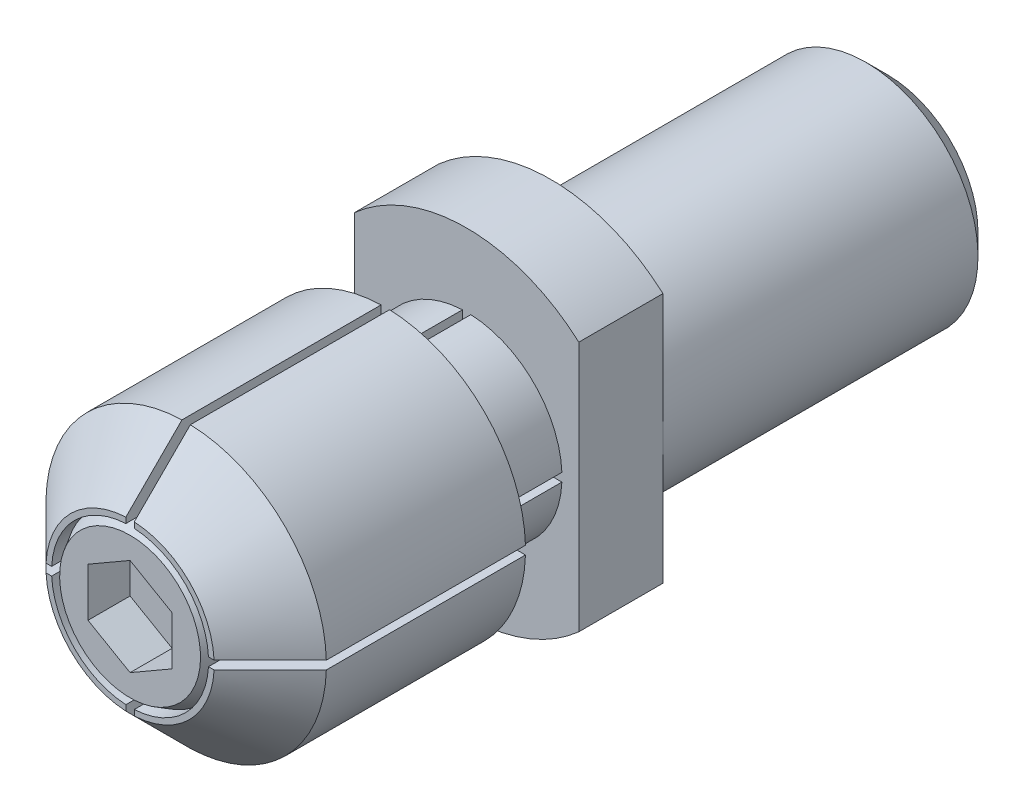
ISO-10303-21;
HEADER;
FILE_DESCRIPTION(('STEP AP214'),'2;1');
FILE_NAME('part.step','',(''),(''),'','','');
FILE_SCHEMA(('AUTOMOTIVE_DESIGN { 1 0 10303 214 1 1 1 1 }'));
ENDSEC;
DATA;
#1=APPLICATION_CONTEXT('core data for automotive mechanical design processes');
#2=APPLICATION_PROTOCOL_DEFINITION('international standard','automotive_design',2000,#1);
#3=PRODUCT_CONTEXT('',#1,'mechanical');
#4=PRODUCT('Part','Part','',(#3));
#5=PRODUCT_RELATED_PRODUCT_CATEGORY('part','',(#4));
#6=PRODUCT_DEFINITION_FORMATION('','',#4);
#7=PRODUCT_DEFINITION_CONTEXT('part definition',#1,'design');
#8=PRODUCT_DEFINITION('design','',#6,#7);
#9=PRODUCT_DEFINITION_SHAPE('','',#8);
#10=(LENGTH_UNIT() NAMED_UNIT(*) SI_UNIT(.MILLI.,.METRE.));
#11=(NAMED_UNIT(*) PLANE_ANGLE_UNIT() SI_UNIT($,.RADIAN.));
#12=(NAMED_UNIT(*) SI_UNIT($,.STERADIAN.) SOLID_ANGLE_UNIT());
#13=UNCERTAINTY_MEASURE_WITH_UNIT(LENGTH_MEASURE(1.E-05),#10,'distance_accuracy_value','');
#14=(GEOMETRIC_REPRESENTATION_CONTEXT(3) GLOBAL_UNCERTAINTY_ASSIGNED_CONTEXT((#13)) GLOBAL_UNIT_ASSIGNED_CONTEXT((#10,
#11,#12)) REPRESENTATION_CONTEXT('',''));
#15=CARTESIAN_POINT('',(0.,0.,0.));
#16=DIRECTION('',(0.,0.,1.));
#17=DIRECTION('',(1.,0.,0.));
#18=AXIS2_PLACEMENT_3D('',#15,#16,#17);
#19=CARTESIAN_POINT('',(0.,0.,15.));
#20=DIRECTION('',(0.,0.,-1.));
#21=DIRECTION('',(0.,1.,0.));
#22=AXIS2_PLACEMENT_3D('',#19,#20,#21);
#23=PLANE('',#22);
#24=CARTESIAN_POINT('',(0.,0.,15.));
#25=DIRECTION('',(0.,0.,-1.));
#26=DIRECTION('',(0.,1.,0.));
#27=AXIS2_PLACEMENT_3D('',#24,#25,#26);
#28=CIRCLE('',#27,2.8);
#29=CARTESIAN_POINT('',(2.79597925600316,0.15,15.));
#30=VERTEX_POINT('',#29);
#31=CARTESIAN_POINT('',(0.15,2.79597925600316,15.));
#32=VERTEX_POINT('',#31);
#33=EDGE_CURVE('E314',#30,#32,#28,.F.);
#34=ORIENTED_EDGE('',*,*,#33,.F.);
#35=DIRECTION('',(-1.,0.,0.));
#36=VECTOR('',#35,1.);
#37=CARTESIAN_POINT('',(2.79597925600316,0.15,15.));
#38=LINE('',#37,#36);
#39=CARTESIAN_POINT('',(2.99624765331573,0.15,15.));
#40=VERTEX_POINT('',#39);
#41=EDGE_CURVE('E307',#40,#30,#38,.T.);
#42=ORIENTED_EDGE('',*,*,#41,.F.);
#43=CARTESIAN_POINT('',(0.,0.,15.));
#44=DIRECTION('',(0.,0.,-1.));
#45=DIRECTION('',(0.,1.,0.));
#46=AXIS2_PLACEMENT_3D('',#43,#44,#45);
#47=CIRCLE('',#46,3.);
#48=CARTESIAN_POINT('',(0.15,2.99624765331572,15.));
#49=VERTEX_POINT('',#48);
#50=EDGE_CURVE('E694',#49,#40,#47,.T.);
#51=ORIENTED_EDGE('',*,*,#50,.F.);
#52=DIRECTION('',(0.,1.,0.));
#53=VECTOR('',#52,1.);
#54=CARTESIAN_POINT('',(0.15,3.5115222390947,15.));
#55=LINE('',#54,#53);
#56=EDGE_CURVE('E359',#32,#49,#55,.T.);
#57=ORIENTED_EDGE('',*,*,#56,.F.);
#58=EDGE_LOOP('',(#34,#42,#51,#57));
#59=FACE_BOUND('',#58,.T.);
#60=ADVANCED_FACE('F14',(#59),#23,.F.);
#61=CARTESIAN_POINT('',(-0.15,2.79597925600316,15.));
#62=VERTEX_POINT('',#61);
#63=CARTESIAN_POINT('',(-2.79597925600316,0.15,15.));
#64=VERTEX_POINT('',#63);
#65=EDGE_CURVE('E317',#62,#64,#28,.F.);
#66=ORIENTED_EDGE('',*,*,#65,.F.);
#67=DIRECTION('',(0.,-1.,0.));
#68=VECTOR('',#67,1.);
#69=CARTESIAN_POINT('',(-0.15,3.5115222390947,15.));
#70=LINE('',#69,#68);
#71=CARTESIAN_POINT('',(-0.15,2.99624765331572,15.));
#72=VERTEX_POINT('',#71);
#73=EDGE_CURVE('E345',#72,#62,#70,.T.);
#74=ORIENTED_EDGE('',*,*,#73,.F.);
#75=CARTESIAN_POINT('',(-2.99624765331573,0.15,15.));
#76=VERTEX_POINT('',#75);
#77=EDGE_CURVE('E596',#76,#72,#47,.T.);
#78=ORIENTED_EDGE('',*,*,#77,.F.);
#79=DIRECTION('',(-1.,0.,0.));
#80=VECTOR('',#79,1.);
#81=CARTESIAN_POINT('',(-3.80508874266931,0.15,15.));
#82=LINE('',#81,#80);
#83=EDGE_CURVE('E1106',#64,#76,#82,.T.);
#84=ORIENTED_EDGE('',*,*,#83,.F.);
#85=EDGE_LOOP('',(#66,#74,#78,#84));
#86=FACE_BOUND('',#85,.T.);
#87=ADVANCED_FACE('F531',(#86),#23,.F.);
#88=CARTESIAN_POINT('',(2.99624765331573,-0.15,15.));
#89=VERTEX_POINT('',#88);
#90=CARTESIAN_POINT('',(0.15,-2.99624765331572,15.));
#91=VERTEX_POINT('',#90);
#92=EDGE_CURVE('E306',#89,#91,#47,.T.);
#93=ORIENTED_EDGE('',*,*,#92,.F.);
#94=DIRECTION('',(1.,0.,0.));
#95=VECTOR('',#94,1.);
#96=CARTESIAN_POINT('',(2.79597925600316,-0.15,15.));
#97=LINE('',#96,#95);
#98=CARTESIAN_POINT('',(2.79597925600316,-0.15,15.));
#99=VERTEX_POINT('',#98);
#100=EDGE_CURVE('E289',#99,#89,#97,.T.);
#101=ORIENTED_EDGE('',*,*,#100,.F.);
#102=CARTESIAN_POINT('',(0.15,-2.79597925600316,15.));
#103=VERTEX_POINT('',#102);
#104=EDGE_CURVE('E304',#103,#99,#28,.F.);
#105=ORIENTED_EDGE('',*,*,#104,.F.);
#106=DIRECTION('',(0.,1.,0.));
#107=VECTOR('',#106,1.);
#108=CARTESIAN_POINT('',(0.15,-2.79597925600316,15.));
#109=LINE('',#108,#107);
#110=EDGE_CURVE('E1092',#91,#103,#109,.T.);
#111=ORIENTED_EDGE('',*,*,#110,.F.);
#112=EDGE_LOOP('',(#93,#101,#105,#111));
#113=FACE_BOUND('',#112,.T.);
#114=ADVANCED_FACE('F302',(#113),#23,.F.);
#115=CARTESIAN_POINT('',(0.,0.,15.8289061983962));
#116=DIRECTION('',(0.,0.,1.));
#117=DIRECTION('',(0.,-1.,0.));
#118=AXIS2_PLACEMENT_3D('',#115,#116,#117);
#119=CYLINDRICAL_SURFACE('',#118,2.8);
#120=DIRECTION('',(0.,0.,1.));
#121=VECTOR('',#120,1.);
#122=CARTESIAN_POINT('',(2.79597925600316,0.15,15.8289061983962));
#123=LINE('',#122,#121);
#124=CARTESIAN_POINT('',(2.79597925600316,0.15,14.5));
#125=VERTEX_POINT('',#124);
#126=EDGE_CURVE('E9',#30,#125,#123,.F.);
#127=ORIENTED_EDGE('',*,*,#126,.F.);
#128=ORIENTED_EDGE('',*,*,#33,.T.);
#129=DIRECTION('',(0.,0.,1.));
#130=VECTOR('',#129,1.);
#131=CARTESIAN_POINT('',(0.15,2.79597925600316,15.8289061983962));
#132=LINE('',#131,#130);
#133=CARTESIAN_POINT('',(0.15,2.79597925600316,14.5));
#134=VERTEX_POINT('',#133);
#135=EDGE_CURVE('E336',#134,#32,#132,.T.);
#136=ORIENTED_EDGE('',*,*,#135,.F.);
#137=CARTESIAN_POINT('',(0.,0.,14.5));
#138=DIRECTION('',(0.,0.,1.));
#139=DIRECTION('',(0.,-1.,0.));
#140=AXIS2_PLACEMENT_3D('',#137,#138,#139);
#141=CIRCLE('',#140,2.8);
#142=EDGE_CURVE('E374',#125,#134,#141,.T.);
#143=ORIENTED_EDGE('',*,*,#142,.F.);
#144=EDGE_LOOP('',(#127,#128,#136,#143));
#145=FACE_BOUND('',#144,.T.);
#146=ADVANCED_FACE('F562',(#145),#119,.F.);
#147=DIRECTION('',(0.,0.,1.));
#148=VECTOR('',#147,1.);
#149=CARTESIAN_POINT('',(-0.15,2.79597925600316,15.8289061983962));
#150=LINE('',#149,#148);
#151=CARTESIAN_POINT('',(-0.15,2.79597925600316,14.5));
#152=VERTEX_POINT('',#151);
#153=EDGE_CURVE('E298',#62,#152,#150,.F.);
#154=ORIENTED_EDGE('',*,*,#153,.F.);
#155=ORIENTED_EDGE('',*,*,#65,.T.);
#156=DIRECTION('',(0.,0.,1.));
#157=VECTOR('',#156,1.);
#158=CARTESIAN_POINT('',(-2.79597925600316,0.15,15.8289061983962));
#159=LINE('',#158,#157);
#160=CARTESIAN_POINT('',(-2.79597925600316,0.15,14.5));
#161=VERTEX_POINT('',#160);
#162=EDGE_CURVE('E331',#161,#64,#159,.T.);
#163=ORIENTED_EDGE('',*,*,#162,.F.);
#164=EDGE_CURVE('E363',#152,#161,#141,.T.);
#165=ORIENTED_EDGE('',*,*,#164,.F.);
#166=EDGE_LOOP('',(#154,#155,#163,#165));
#167=FACE_BOUND('',#166,.T.);
#168=ADVANCED_FACE('F364',(#167),#119,.F.);
#169=DIRECTION('',(0.,0.,1.));
#170=VECTOR('',#169,1.);
#171=CARTESIAN_POINT('',(2.79597925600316,-0.15,15.8289061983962));
#172=LINE('',#171,#170);
#173=CARTESIAN_POINT('',(2.79597925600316,-0.15,14.5));
#174=VERTEX_POINT('',#173);
#175=EDGE_CURVE('E22',#174,#99,#172,.T.);
#176=ORIENTED_EDGE('',*,*,#175,.F.);
#177=CARTESIAN_POINT('',(0.15,-2.79597925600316,14.5));
#178=VERTEX_POINT('',#177);
#179=EDGE_CURVE('E319',#178,#174,#141,.T.);
#180=ORIENTED_EDGE('',*,*,#179,.F.);
#181=DIRECTION('',(0.,0.,1.));
#182=VECTOR('',#181,1.);
#183=CARTESIAN_POINT('',(0.15,-2.79597925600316,15.8289061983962));
#184=LINE('',#183,#182);
#185=EDGE_CURVE('E312',#103,#178,#184,.F.);
#186=ORIENTED_EDGE('',*,*,#185,.F.);
#187=ORIENTED_EDGE('',*,*,#104,.T.);
#188=EDGE_LOOP('',(#176,#180,#186,#187));
#189=FACE_BOUND('',#188,.T.);
#190=ADVANCED_FACE('F311',(#189),#119,.F.);
#191=CARTESIAN_POINT('',(0.,0.,15.));
#192=DIRECTION('',(0.,0.,-1.));
#193=DIRECTION('',(0.,1.,0.));
#194=AXIS2_PLACEMENT_3D('',#191,#192,#193);
#195=CONICAL_SURFACE('',#194,3.,0.785398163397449);
#196=CARTESIAN_POINT('',(-0.149999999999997,8.35007973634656,9.64857307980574));
#197=CARTESIAN_POINT('',(-0.149999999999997,8.04989087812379,9.94871304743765));
#198=CARTESIAN_POINT('',(-0.149999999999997,7.74969984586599,10.248850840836));
#199=CARTESIAN_POINT('',(-0.149999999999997,7.1493103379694,10.8491189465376));
#200=CARTESIAN_POINT('',(-0.149999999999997,6.84911186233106,11.1492492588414));
#201=CARTESIAN_POINT('',(-0.149999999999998,6.24870439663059,11.7494992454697));
#202=CARTESIAN_POINT('',(-0.149999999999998,5.94849540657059,12.0496189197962));
#203=CARTESIAN_POINT('',(-0.149999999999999,5.34806099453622,12.6498418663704));
#204=CARTESIAN_POINT('',(-0.15,5.04783557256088,12.949945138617));
#205=CARTESIAN_POINT('',(-0.15,4.44735702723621,13.5501242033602));
#206=CARTESIAN_POINT('',(-0.149999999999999,4.14710390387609,13.8501999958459));
#207=CARTESIAN_POINT('',(-0.149999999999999,3.54654777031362,14.4503015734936));
#208=CARTESIAN_POINT('',(-0.15,3.24624476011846,14.7503273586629));
#209=CARTESIAN_POINT('',(-0.15,2.7957067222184,15.2002825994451));
#210=CARTESIAN_POINT('',(-0.15,2.64551341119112,15.3502538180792));
#211=CARTESIAN_POINT('',(-0.15,2.34507730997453,15.6501466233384));
#212=CARTESIAN_POINT('',(-0.150000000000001,2.19483451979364,15.8000682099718));
#213=CARTESIAN_POINT('',(-0.150000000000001,1.89427233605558,16.0998348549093));
#214=CARTESIAN_POINT('',(-0.150000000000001,1.74395294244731,16.2496799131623));
#215=CARTESIAN_POINT('',(-0.150000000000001,1.44311180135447,16.5491669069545));
#216=CARTESIAN_POINT('',(-0.150000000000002,1.2925900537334,16.6988088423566));
#217=CARTESIAN_POINT('',(-0.150000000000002,1.14190430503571,16.8482858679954));
#218=B_SPLINE_CURVE_WITH_KNOTS('',3,(#196,#197,#198,#199,#200,#201,#202,#203,#204,#205,#206,
#207,#208,#209,#210,#211,#212,#213,#214,#215,#216,#217),.UNSPECIFIED.,.F.,.F.,(4,2,2,2,2,2,2,2,
2,2,4),(0.,1.27348975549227,2.54697943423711,3.82046885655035,5.09395835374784,6.36744834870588,
7.64093815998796,8.27768344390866,8.9144286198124,9.55117422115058,10.1879202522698),.UNSPECIFIED.);
#219=CARTESIAN_POINT('',(-0.15,4.99774949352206,13.));
#220=VERTEX_POINT('',#219);
#221=EDGE_CURVE('E592',#220,#72,#218,.T.);
#222=ORIENTED_EDGE('',*,*,#221,.F.);
#223=CARTESIAN_POINT('',(0.,0.,13.));
#224=DIRECTION('',(0.,0.,-1.));
#225=DIRECTION('',(0.,1.,0.));
#226=AXIS2_PLACEMENT_3D('',#223,#224,#225);
#227=CIRCLE('',#226,5.);
#228=CARTESIAN_POINT('',(-4.99774949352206,0.15,13.));
#229=VERTEX_POINT('',#228);
#230=EDGE_CURVE('E594',#229,#220,#227,.T.);
#231=ORIENTED_EDGE('',*,*,#230,.F.);
#232=CARTESIAN_POINT('',(-1.14190430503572,0.15,16.8482858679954));
#233=CARTESIAN_POINT('',(-1.22174775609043,0.15,16.7691116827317));
#234=CARTESIAN_POINT('',(-1.30153240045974,0.150000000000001,16.6898782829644));
#235=CARTESIAN_POINT('',(-1.46101920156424,0.150000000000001,16.5313285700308));
#236=CARTESIAN_POINT('',(-1.5407213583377,0.150000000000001,16.4520122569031));
#237=CARTESIAN_POINT('',(-1.77975680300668,0.15,16.2139922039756));
#238=CARTESIAN_POINT('',(-1.9390191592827,0.15,16.0552172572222));
#239=CARTESIAN_POINT('',(-2.54011923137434,0.15,15.455660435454));
#240=CARTESIAN_POINT('',(-2.98169377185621,0.15,15.0146148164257));
#241=CARTESIAN_POINT('',(-3.86472088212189,0.15,14.132400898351));
#242=CARTESIAN_POINT('',(-4.30617345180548,0.15,13.6912325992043));
#243=CARTESIAN_POINT('',(-5.34807847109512,0.15,12.6498584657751));
#244=CARTESIAN_POINT('',(-5.94850569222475,0.15,12.0496273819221));
#245=CARTESIAN_POINT('',(-7.14931249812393,0.15,10.8491191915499));
#246=CARTESIAN_POINT('',(-7.74969208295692,0.149999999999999,10.2488420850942));
#247=CARTESIAN_POINT('',(-8.35007973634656,0.149999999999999,9.64857307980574));
#248=B_SPLINE_CURVE_WITH_KNOTS('',3,(#232,#233,#234,#235,#236,#237,#238,#239,#240,#241,#242,
#243,#244,#245,#246,#247),.UNSPECIFIED.,.F.,.F.,(4,2,2,2,2,2,2,4),(0.,0.337330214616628,
0.674660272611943,1.34931999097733,3.22164019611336,5.09396193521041,7.64094283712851,
10.1879202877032),.UNSPECIFIED.);
#249=EDGE_CURVE('E428',#76,#229,#248,.T.);
#250=ORIENTED_EDGE('',*,*,#249,.F.);
#251=ORIENTED_EDGE('',*,*,#77,.T.);
#252=EDGE_LOOP('',(#222,#231,#250,#251));
#253=FACE_BOUND('',#252,.T.);
#254=ADVANCED_FACE('F438',(#253),#195,.T.);
#255=CARTESIAN_POINT('',(0.15,1.14190430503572,16.8482858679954));
#256=CARTESIAN_POINT('',(0.15,1.22174775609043,16.7691116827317));
#257=CARTESIAN_POINT('',(0.15,1.30153240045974,16.6898782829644));
#258=CARTESIAN_POINT('',(0.15,1.46101920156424,16.5313285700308));
#259=CARTESIAN_POINT('',(0.15,1.5407213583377,16.4520122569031));
#260=CARTESIAN_POINT('',(0.15,1.77975680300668,16.2139922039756));
#261=CARTESIAN_POINT('',(0.15,1.9390191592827,16.0552172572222));
#262=CARTESIAN_POINT('',(0.15,2.54011923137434,15.455660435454));
#263=CARTESIAN_POINT('',(0.15,2.98169377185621,15.0146148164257));
#264=CARTESIAN_POINT('',(0.15,3.86472088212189,14.132400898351));
#265=CARTESIAN_POINT('',(0.15,4.30617345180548,13.6912325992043));
#266=CARTESIAN_POINT('',(0.15,5.34807847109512,12.6498584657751));
#267=CARTESIAN_POINT('',(0.15,5.94850569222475,12.0496273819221));
#268=CARTESIAN_POINT('',(0.15,7.14931249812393,10.8491191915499));
#269=CARTESIAN_POINT('',(0.15,7.74969208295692,10.2488420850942));
#270=CARTESIAN_POINT('',(0.15,8.35007973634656,9.64857307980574));
#271=B_SPLINE_CURVE_WITH_KNOTS('',3,(#255,#256,#257,#258,#259,#260,#261,#262,#263,#264,#265,
#266,#267,#268,#269,#270),.UNSPECIFIED.,.F.,.F.,(4,2,2,2,2,2,2,4),(0.,0.337330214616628,
0.674660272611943,1.34931999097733,3.22164019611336,5.09396193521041,7.64094283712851,
10.1879202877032),.UNSPECIFIED.);
#272=CARTESIAN_POINT('',(0.15,4.99774949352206,13.));
#273=VERTEX_POINT('',#272);
#274=EDGE_CURVE('E603',#49,#273,#271,.T.);
#275=ORIENTED_EDGE('',*,*,#274,.F.);
#276=ORIENTED_EDGE('',*,*,#50,.T.);
#277=CARTESIAN_POINT('',(5.93961697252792,0.149999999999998,12.0584892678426));
#278=CARTESIAN_POINT('',(5.71521832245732,0.149999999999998,12.2828156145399));
#279=CARTESIAN_POINT('',(5.49081635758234,0.149999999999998,12.5071386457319));
#280=CARTESIAN_POINT('',(5.04200077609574,0.149999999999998,12.9557727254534));
#281=CARTESIAN_POINT('',(4.8175871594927,0.149999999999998,13.1800837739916));
#282=CARTESIAN_POINT('',(4.36874337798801,0.149999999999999,13.6286884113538));
#283=CARTESIAN_POINT('',(4.14431321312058,0.149999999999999,13.8529820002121));
#284=CARTESIAN_POINT('',(3.6954251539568,0.149999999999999,14.301541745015));
#285=CARTESIAN_POINT('',(3.47096725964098,0.15,14.5258079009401));
#286=CARTESIAN_POINT('',(3.02200373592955,0.15,14.9742942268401));
#287=CARTESIAN_POINT('',(2.79749810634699,0.15,15.1985143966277));
#288=CARTESIAN_POINT('',(2.4606681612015,0.15,15.5347725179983));
#289=CARTESIAN_POINT('',(2.34837972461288,0.150000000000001,15.646846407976));
#290=CARTESIAN_POINT('',(2.12376569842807,0.150000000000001,15.8709571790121));
#291=CARTESIAN_POINT('',(2.01144010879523,0.150000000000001,15.9829940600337));
#292=CARTESIAN_POINT('',(1.78672803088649,0.150000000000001,16.2070084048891));
#293=CARTESIAN_POINT('',(1.67434154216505,0.150000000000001,16.318985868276));
#294=CARTESIAN_POINT('',(1.44946449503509,0.150000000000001,16.5428356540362));
#295=CARTESIAN_POINT('',(1.3369739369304,0.150000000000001,16.6547079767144));
#296=CARTESIAN_POINT('',(1.16807460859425,0.150000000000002,16.8223532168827));
#297=CARTESIAN_POINT('',(1.11174723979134,0.150000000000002,16.8782080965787));
#298=CARTESIAN_POINT('',(0.999003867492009,0.150000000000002,16.9898279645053));
#299=CARTESIAN_POINT('',(0.942587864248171,0.150000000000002,17.045592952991));
#300=CARTESIAN_POINT('',(0.829619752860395,0.150000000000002,17.1569867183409));
#301=CARTESIAN_POINT('',(0.773067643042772,0.150000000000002,17.212615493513));
#302=CARTESIAN_POINT('',(0.659670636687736,0.150000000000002,17.3235747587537));
#303=CARTESIAN_POINT('',(0.602825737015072,0.150000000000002,17.3789052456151));
#304=CARTESIAN_POINT('',(0.545756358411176,0.150000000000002,17.4340052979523));
#305=B_SPLINE_CURVE_WITH_KNOTS('',3,(#277,#278,#279,#280,#281,#282,#283,#284,#285,#286,#287,
#288,#289,#290,#291,#292,#293,#294,#295,#296,#297,#298,#299,#300,#301,#302,#303,#304),
.UNSPECIFIED.,.F.,.F.,(4,2,2,2,2,2,2,2,2,2,2,2,2,4),(0.,0.951889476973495,1.90377826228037,
2.85566513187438,3.80755267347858,4.75944401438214,5.23538859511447,5.71133364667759,
6.1872822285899,6.66322942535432,6.90120592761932,7.13918175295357,7.37716051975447,
7.61514184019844),.UNSPECIFIED.);
#306=CARTESIAN_POINT('',(4.99774949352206,0.149999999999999,13.));
#307=VERTEX_POINT('',#306);
#308=EDGE_CURVE('E631',#307,#40,#305,.T.);
#309=ORIENTED_EDGE('',*,*,#308,.F.);
#310=EDGE_CURVE('E695',#273,#307,#227,.T.);
#311=ORIENTED_EDGE('',*,*,#310,.F.);
#312=EDGE_LOOP('',(#275,#276,#309,#311));
#313=FACE_BOUND('',#312,.T.);
#314=ADVANCED_FACE('F583',(#313),#195,.T.);
#315=CARTESIAN_POINT('',(0.545756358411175,-0.15,17.4340052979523));
#316=CARTESIAN_POINT('',(0.585525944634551,-0.15,17.3956352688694));
#317=CARTESIAN_POINT('',(0.625172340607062,-0.15,17.3571383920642));
#318=CARTESIAN_POINT('',(0.704292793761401,-0.15,17.2799685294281));
#319=CARTESIAN_POINT('',(0.743766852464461,-0.15,17.2412955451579));
#320=CARTESIAN_POINT('',(0.862041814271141,-0.15,17.1251285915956));
#321=CARTESIAN_POINT('',(0.940696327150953,-0.15,17.0474858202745));
#322=CARTESIAN_POINT('',(1.17639778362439,-0.15,16.8143031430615));
#323=CARTESIAN_POINT('',(1.33318774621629,-0.15,16.6585038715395));
#324=CARTESIAN_POINT('',(1.64655380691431,-0.15,16.3466906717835));
#325=CARTESIAN_POINT('',(1.8031299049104,-0.15,16.1906767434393));
#326=CARTESIAN_POINT('',(2.27271018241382,-0.15,15.7224792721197));
#327=CARTESIAN_POINT('',(2.58556274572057,-0.15,15.4101436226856));
#328=CARTESIAN_POINT('',(2.95638841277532,-0.15,15.0398096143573));
#329=CARTESIAN_POINT('',(3.01441087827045,-0.15,14.9818605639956));
#330=CARTESIAN_POINT('',(3.13045136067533,-0.15,14.8659583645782));
#331=CARTESIAN_POINT('',(3.18846937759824,-0.15,14.8080052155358));
#332=CARTESIAN_POINT('',(3.69544675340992,-0.15,14.3015693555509));
#333=CARTESIAN_POINT('',(4.14432080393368,-0.15,13.8530012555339));
#334=CARTESIAN_POINT('',(5.0419988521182,-0.15,12.9557818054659));
#335=CARTESIAN_POINT('',(5.49080284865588,-0.15,12.5071304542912));
#336=CARTESIAN_POINT('',(5.93961697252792,-0.15,12.0584892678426));
#337=B_SPLINE_CURVE_WITH_KNOTS('',3,(#315,#316,#317,#318,#319,#320,#321,#322,#323,#324,#325,
#326,#327,#328,#329,#330,#331,#332,#333,#334,#335,#336),.UNSPECIFIED.,.F.,.F.,(4,2,2,2,2,2,2,2,
2,2,4),(0.,0.165784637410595,0.331567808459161,0.663130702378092,1.32623505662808,
1.98933975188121,3.31556437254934,3.56157716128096,3.80758919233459,5.71135157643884,
7.61514186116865),.UNSPECIFIED.);
#338=CARTESIAN_POINT('',(4.99774949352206,-0.15,13.));
#339=VERTEX_POINT('',#338);
#340=EDGE_CURVE('E639',#89,#339,#337,.T.);
#341=ORIENTED_EDGE('',*,*,#340,.F.);
#342=ORIENTED_EDGE('',*,*,#92,.T.);
#343=CARTESIAN_POINT('',(0.149999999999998,-5.93961697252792,12.0584892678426));
#344=CARTESIAN_POINT('',(0.149999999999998,-5.71521832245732,12.2828156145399));
#345=CARTESIAN_POINT('',(0.149999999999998,-5.49081635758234,12.5071386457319));
#346=CARTESIAN_POINT('',(0.149999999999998,-5.04200077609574,12.9557727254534));
#347=CARTESIAN_POINT('',(0.149999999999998,-4.8175871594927,13.1800837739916));
#348=CARTESIAN_POINT('',(0.149999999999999,-4.36874337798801,13.6286884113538));
#349=CARTESIAN_POINT('',(0.149999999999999,-4.14431321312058,13.8529820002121));
#350=CARTESIAN_POINT('',(0.149999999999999,-3.6954251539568,14.301541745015));
#351=CARTESIAN_POINT('',(0.15,-3.47096725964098,14.5258079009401));
#352=CARTESIAN_POINT('',(0.15,-3.02200373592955,14.9742942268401));
#353=CARTESIAN_POINT('',(0.15,-2.79749810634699,15.1985143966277));
#354=CARTESIAN_POINT('',(0.15,-2.4606681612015,15.5347725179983));
#355=CARTESIAN_POINT('',(0.150000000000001,-2.34837972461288,15.646846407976));
#356=CARTESIAN_POINT('',(0.150000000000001,-2.12376569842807,15.8709571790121));
#357=CARTESIAN_POINT('',(0.150000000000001,-2.01144010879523,15.9829940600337));
#358=CARTESIAN_POINT('',(0.150000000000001,-1.78672803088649,16.2070084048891));
#359=CARTESIAN_POINT('',(0.150000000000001,-1.67434154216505,16.318985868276));
#360=CARTESIAN_POINT('',(0.150000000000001,-1.44946449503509,16.5428356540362));
#361=CARTESIAN_POINT('',(0.150000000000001,-1.3369739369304,16.6547079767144));
#362=CARTESIAN_POINT('',(0.150000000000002,-1.16807460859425,16.8223532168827));
#363=CARTESIAN_POINT('',(0.150000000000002,-1.11174723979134,16.8782080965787));
#364=CARTESIAN_POINT('',(0.150000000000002,-0.999003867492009,16.9898279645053));
#365=CARTESIAN_POINT('',(0.150000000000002,-0.942587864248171,17.045592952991));
#366=CARTESIAN_POINT('',(0.150000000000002,-0.829619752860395,17.1569867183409));
#367=CARTESIAN_POINT('',(0.150000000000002,-0.773067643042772,17.212615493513));
#368=CARTESIAN_POINT('',(0.150000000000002,-0.659670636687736,17.3235747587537));
#369=CARTESIAN_POINT('',(0.150000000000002,-0.602825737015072,17.3789052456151));
#370=CARTESIAN_POINT('',(0.150000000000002,-0.545756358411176,17.4340052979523));
#371=B_SPLINE_CURVE_WITH_KNOTS('',3,(#343,#344,#345,#346,#347,#348,#349,#350,#351,#352,#353,
#354,#355,#356,#357,#358,#359,#360,#361,#362,#363,#364,#365,#366,#367,#368,#369,#370),
.UNSPECIFIED.,.F.,.F.,(4,2,2,2,2,2,2,2,2,2,2,2,2,4),(0.,0.951889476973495,1.90377826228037,
2.85566513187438,3.80755267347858,4.75944401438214,5.23538859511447,5.71133364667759,
6.1872822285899,6.66322942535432,6.90120592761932,7.13918175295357,7.37716051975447,
7.61514184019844),.UNSPECIFIED.);
#372=CARTESIAN_POINT('',(0.15,-4.99774949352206,13.));
#373=VERTEX_POINT('',#372);
#374=EDGE_CURVE('E654',#373,#91,#371,.T.);
#375=ORIENTED_EDGE('',*,*,#374,.F.);
#376=EDGE_CURVE('E692',#339,#373,#227,.T.);
#377=ORIENTED_EDGE('',*,*,#376,.F.);
#378=EDGE_LOOP('',(#341,#342,#375,#377));
#379=FACE_BOUND('',#378,.T.);
#380=ADVANCED_FACE('F525',(#379),#195,.T.);
#381=CARTESIAN_POINT('',(-0.15,-0.545756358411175,17.4340052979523));
#382=CARTESIAN_POINT('',(-0.15,-0.585525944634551,17.3956352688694));
#383=CARTESIAN_POINT('',(-0.15,-0.625172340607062,17.3571383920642));
#384=CARTESIAN_POINT('',(-0.15,-0.704292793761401,17.2799685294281));
#385=CARTESIAN_POINT('',(-0.15,-0.743766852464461,17.2412955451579));
#386=CARTESIAN_POINT('',(-0.15,-0.862041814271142,17.1251285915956));
#387=CARTESIAN_POINT('',(-0.15,-0.940696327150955,17.0474858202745));
#388=CARTESIAN_POINT('',(-0.15,-1.17639778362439,16.8143031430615));
#389=CARTESIAN_POINT('',(-0.15,-1.33318774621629,16.6585038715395));
#390=CARTESIAN_POINT('',(-0.150000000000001,-1.64655380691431,16.3466906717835));
#391=CARTESIAN_POINT('',(-0.15,-1.8031299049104,16.1906767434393));
#392=CARTESIAN_POINT('',(-0.15,-2.27271018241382,15.7224792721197));
#393=CARTESIAN_POINT('',(-0.149999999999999,-2.58556274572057,15.4101436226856));
#394=CARTESIAN_POINT('',(-0.15,-2.95638841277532,15.0398096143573));
#395=CARTESIAN_POINT('',(-0.15,-3.01441087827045,14.9818605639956));
#396=CARTESIAN_POINT('',(-0.15,-3.13045136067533,14.8659583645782));
#397=CARTESIAN_POINT('',(-0.15,-3.18846937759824,14.8080052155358));
#398=CARTESIAN_POINT('',(-0.149999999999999,-3.69544675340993,14.3015693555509));
#399=CARTESIAN_POINT('',(-0.15,-4.14432080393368,13.8530012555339));
#400=CARTESIAN_POINT('',(-0.15,-5.0419988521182,12.9557818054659));
#401=CARTESIAN_POINT('',(-0.150000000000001,-5.49080284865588,12.5071304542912));
#402=CARTESIAN_POINT('',(-0.15,-5.93961697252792,12.0584892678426));
#403=B_SPLINE_CURVE_WITH_KNOTS('',3,(#381,#382,#383,#384,#385,#386,#387,#388,#389,#390,#391,
#392,#393,#394,#395,#396,#397,#398,#399,#400,#401,#402),.UNSPECIFIED.,.F.,.F.,(4,2,2,2,2,2,2,2,
2,2,4),(0.,0.165784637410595,0.331567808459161,0.663130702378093,1.32623505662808,
1.98933975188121,3.31556437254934,3.56157716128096,3.80758919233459,5.71135157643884,
7.61514186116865),.UNSPECIFIED.);
#404=CARTESIAN_POINT('',(-0.15,-2.99624765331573,15.));
#405=VERTEX_POINT('',#404);
#406=CARTESIAN_POINT('',(-0.150000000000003,-4.99774949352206,13.));
#407=VERTEX_POINT('',#406);
#408=EDGE_CURVE('E662',#405,#407,#403,.T.);
#409=ORIENTED_EDGE('',*,*,#408,.F.);
#410=CARTESIAN_POINT('',(-2.99624765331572,-0.15,15.));
#411=VERTEX_POINT('',#410);
#412=EDGE_CURVE('E1115',#405,#411,#47,.T.);
#413=ORIENTED_EDGE('',*,*,#412,.T.);
#414=CARTESIAN_POINT('',(-8.35007973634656,-0.149999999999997,9.64857307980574));
#415=CARTESIAN_POINT('',(-8.04989087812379,-0.149999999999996,9.94871304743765));
#416=CARTESIAN_POINT('',(-7.74969984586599,-0.149999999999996,10.248850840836));
#417=CARTESIAN_POINT('',(-7.1493103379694,-0.149999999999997,10.8491189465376));
#418=CARTESIAN_POINT('',(-6.84911186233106,-0.149999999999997,11.1492492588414));
#419=CARTESIAN_POINT('',(-6.24870439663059,-0.149999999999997,11.7494992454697));
#420=CARTESIAN_POINT('',(-5.94849540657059,-0.149999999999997,12.0496189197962));
#421=CARTESIAN_POINT('',(-5.34806099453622,-0.149999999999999,12.6498418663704));
#422=CARTESIAN_POINT('',(-5.04783557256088,-0.15,12.949945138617));
#423=CARTESIAN_POINT('',(-4.44735702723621,-0.15,13.5501242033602));
#424=CARTESIAN_POINT('',(-4.14710390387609,-0.149999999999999,13.8501999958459));
#425=CARTESIAN_POINT('',(-3.54654777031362,-0.149999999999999,14.4503015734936));
#426=CARTESIAN_POINT('',(-3.24624476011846,-0.15,14.7503273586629));
#427=CARTESIAN_POINT('',(-2.7957067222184,-0.15,15.2002825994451));
#428=CARTESIAN_POINT('',(-2.64551341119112,-0.15,15.3502538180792));
#429=CARTESIAN_POINT('',(-2.34507730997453,-0.15,15.6501466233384));
#430=CARTESIAN_POINT('',(-2.19483451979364,-0.150000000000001,15.8000682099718));
#431=CARTESIAN_POINT('',(-1.89427233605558,-0.150000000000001,16.0998348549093));
#432=CARTESIAN_POINT('',(-1.74395294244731,-0.150000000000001,16.2496799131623));
#433=CARTESIAN_POINT('',(-1.44311180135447,-0.150000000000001,16.5491669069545));
#434=CARTESIAN_POINT('',(-1.2925900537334,-0.150000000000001,16.6988088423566));
#435=CARTESIAN_POINT('',(-1.14190430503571,-0.15,16.8482858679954));
#436=B_SPLINE_CURVE_WITH_KNOTS('',3,(#414,#415,#416,#417,#418,#419,#420,#421,#422,#423,#424,
#425,#426,#427,#428,#429,#430,#431,#432,#433,#434,#435),.UNSPECIFIED.,.F.,.F.,(4,2,2,2,2,2,2,2,
2,2,4),(0.,1.27348975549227,2.54697943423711,3.82046885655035,5.09395835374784,6.36744834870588,
7.64093815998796,8.27768344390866,8.9144286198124,9.55117422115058,10.1879202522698),.UNSPECIFIED.);
#437=CARTESIAN_POINT('',(-4.99774949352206,-0.15,13.));
#438=VERTEX_POINT('',#437);
#439=EDGE_CURVE('E669',#438,#411,#436,.T.);
#440=ORIENTED_EDGE('',*,*,#439,.F.);
#441=EDGE_CURVE('E690',#407,#438,#227,.T.);
#442=ORIENTED_EDGE('',*,*,#441,.F.);
#443=EDGE_LOOP('',(#409,#413,#440,#442));
#444=FACE_BOUND('',#443,.T.);
#445=ADVANCED_FACE('F516',(#444),#195,.T.);
#446=CARTESIAN_POINT('',(0.,0.,3.));
#447=DIRECTION('',(0.,0.,-1.));
#448=DIRECTION('',(0.,1.,0.));
#449=AXIS2_PLACEMENT_3D('',#446,#447,#448);
#450=CYLINDRICAL_SURFACE('',#449,5.);
#451=DIRECTION('',(0.,0.,1.));
#452=VECTOR('',#451,1.);
#453=CARTESIAN_POINT('',(-0.15,4.99774949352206,3.));
#454=LINE('',#453,#452);
#455=CARTESIAN_POINT('',(-0.15,4.99774949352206,5.9));
#456=VERTEX_POINT('',#455);
#457=EDGE_CURVE('E403',#456,#220,#454,.T.);
#458=ORIENTED_EDGE('',*,*,#457,.F.);
#459=CARTESIAN_POINT('',(0.,0.,5.9));
#460=DIRECTION('',(0.,0.,-1.));
#461=DIRECTION('',(0.,1.,0.));
#462=AXIS2_PLACEMENT_3D('',#459,#460,#461);
#463=CIRCLE('',#462,5.);
#464=CARTESIAN_POINT('',(-4.99774949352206,0.15,5.9));
#465=VERTEX_POINT('',#464);
#466=EDGE_CURVE('E687',#465,#456,#463,.T.);
#467=ORIENTED_EDGE('',*,*,#466,.F.);
#468=DIRECTION('',(0.,0.,1.));
#469=VECTOR('',#468,1.);
#470=CARTESIAN_POINT('',(-4.99774949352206,0.15,3.));
#471=LINE('',#470,#469);
#472=EDGE_CURVE('E402',#465,#229,#471,.T.);
#473=ORIENTED_EDGE('',*,*,#472,.T.);
#474=ORIENTED_EDGE('',*,*,#230,.T.);
#475=EDGE_LOOP('',(#458,#467,#473,#474));
#476=FACE_BOUND('',#475,.T.);
#477=ADVANCED_FACE('F513',(#476),#450,.T.);
#478=DIRECTION('',(0.,0.,1.));
#479=VECTOR('',#478,1.);
#480=CARTESIAN_POINT('',(4.99774949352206,0.149999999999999,3.));
#481=LINE('',#480,#479);
#482=CARTESIAN_POINT('',(4.99774949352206,0.149999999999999,5.9));
#483=VERTEX_POINT('',#482);
#484=EDGE_CURVE('E410',#483,#307,#481,.T.);
#485=ORIENTED_EDGE('',*,*,#484,.F.);
#486=CARTESIAN_POINT('',(0.15,4.99774949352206,5.9));
#487=VERTEX_POINT('',#486);
#488=EDGE_CURVE('E697',#487,#483,#463,.T.);
#489=ORIENTED_EDGE('',*,*,#488,.F.);
#490=DIRECTION('',(0.,0.,1.));
#491=VECTOR('',#490,1.);
#492=CARTESIAN_POINT('',(0.15,4.99774949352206,3.));
#493=LINE('',#492,#491);
#494=EDGE_CURVE('E407',#487,#273,#493,.T.);
#495=ORIENTED_EDGE('',*,*,#494,.T.);
#496=ORIENTED_EDGE('',*,*,#310,.T.);
#497=EDGE_LOOP('',(#485,#489,#495,#496));
#498=FACE_BOUND('',#497,.T.);
#499=ADVANCED_FACE('F515',(#498),#450,.T.);
#500=DIRECTION('',(0.,0.,1.));
#501=VECTOR('',#500,1.);
#502=CARTESIAN_POINT('',(0.15,-4.99774949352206,3.));
#503=LINE('',#502,#501);
#504=CARTESIAN_POINT('',(0.15,-4.99774949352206,5.9));
#505=VERTEX_POINT('',#504);
#506=EDGE_CURVE('E416',#505,#373,#503,.T.);
#507=ORIENTED_EDGE('',*,*,#506,.F.);
#508=CARTESIAN_POINT('',(4.99774949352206,-0.15,5.9));
#509=VERTEX_POINT('',#508);
#510=EDGE_CURVE('E686',#509,#505,#463,.T.);
#511=ORIENTED_EDGE('',*,*,#510,.F.);
#512=DIRECTION('',(0.,0.,1.));
#513=VECTOR('',#512,1.);
#514=CARTESIAN_POINT('',(4.99774949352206,-0.15,3.));
#515=LINE('',#514,#513);
#516=EDGE_CURVE('E413',#509,#339,#515,.T.);
#517=ORIENTED_EDGE('',*,*,#516,.T.);
#518=ORIENTED_EDGE('',*,*,#376,.T.);
#519=EDGE_LOOP('',(#507,#511,#517,#518));
#520=FACE_BOUND('',#519,.T.);
#521=ADVANCED_FACE('F523',(#520),#450,.T.);
#522=DIRECTION('',(0.,0.,1.));
#523=VECTOR('',#522,1.);
#524=CARTESIAN_POINT('',(-4.99774949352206,-0.15,3.));
#525=LINE('',#524,#523);
#526=CARTESIAN_POINT('',(-4.99774949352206,-0.15,5.9));
#527=VERTEX_POINT('',#526);
#528=EDGE_CURVE('E422',#527,#438,#525,.T.);
#529=ORIENTED_EDGE('',*,*,#528,.F.);
#530=CARTESIAN_POINT('',(-0.150000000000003,-4.99774949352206,5.9));
#531=VERTEX_POINT('',#530);
#532=EDGE_CURVE('E685',#531,#527,#463,.T.);
#533=ORIENTED_EDGE('',*,*,#532,.F.);
#534=DIRECTION('',(0.,0.,1.));
#535=VECTOR('',#534,1.);
#536=CARTESIAN_POINT('',(-0.150000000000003,-4.99774949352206,3.));
#537=LINE('',#536,#535);
#538=EDGE_CURVE('E419',#531,#407,#537,.T.);
#539=ORIENTED_EDGE('',*,*,#538,.T.);
#540=ORIENTED_EDGE('',*,*,#441,.T.);
#541=EDGE_LOOP('',(#529,#533,#539,#540));
#542=FACE_BOUND('',#541,.T.);
#543=ADVANCED_FACE('F511',(#542),#450,.T.);
#544=CARTESIAN_POINT('',(5.,0.,5.9));
#545=DIRECTION('',(0.,0.,1.));
#546=DIRECTION('',(0.,-1.,0.));
#547=AXIS2_PLACEMENT_3D('',#544,#545,#546);
#548=PLANE('',#547);
#549=DIRECTION('',(0.,1.,0.));
#550=VECTOR('',#549,1.);
#551=CARTESIAN_POINT('',(-0.150000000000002,0.,5.9));
#552=LINE('',#551,#550);
#553=CARTESIAN_POINT('',(-0.15,3.39668956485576,5.9));
#554=VERTEX_POINT('',#553);
#555=EDGE_CURVE('E598',#554,#456,#552,.T.);
#556=ORIENTED_EDGE('',*,*,#555,.F.);
#557=CARTESIAN_POINT('',(0.,0.,5.9));
#558=DIRECTION('',(0.,0.,-1.));
#559=DIRECTION('',(0.,1.,0.));
#560=AXIS2_PLACEMENT_3D('',#557,#558,#559);
#561=CIRCLE('',#560,3.4);
#562=CARTESIAN_POINT('',(-3.39668956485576,0.15,5.9));
#563=VERTEX_POINT('',#562);
#564=EDGE_CURVE('E763',#563,#554,#561,.T.);
#565=ORIENTED_EDGE('',*,*,#564,.F.);
#566=DIRECTION('',(1.,0.,0.));
#567=VECTOR('',#566,1.);
#568=CARTESIAN_POINT('',(5.,0.15,5.9));
#569=LINE('',#568,#567);
#570=EDGE_CURVE('E406',#465,#563,#569,.T.);
#571=ORIENTED_EDGE('',*,*,#570,.F.);
#572=ORIENTED_EDGE('',*,*,#466,.T.);
#573=EDGE_LOOP('',(#556,#565,#571,#572));
#574=FACE_BOUND('',#573,.T.);
#575=ADVANCED_FACE('F508',(#574),#548,.F.);
#576=DIRECTION('',(0.,-1.,0.));
#577=VECTOR('',#576,1.);
#578=CARTESIAN_POINT('',(0.15,0.,5.9));
#579=LINE('',#578,#577);
#580=CARTESIAN_POINT('',(0.15,3.39668956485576,5.9));
#581=VERTEX_POINT('',#580);
#582=EDGE_CURVE('E629',#487,#581,#579,.T.);
#583=ORIENTED_EDGE('',*,*,#582,.F.);
#584=ORIENTED_EDGE('',*,*,#488,.T.);
#585=DIRECTION('',(1.,0.,0.));
#586=VECTOR('',#585,1.);
#587=CARTESIAN_POINT('',(5.,0.149999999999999,5.9));
#588=LINE('',#587,#586);
#589=CARTESIAN_POINT('',(3.39668956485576,0.15,5.9));
#590=VERTEX_POINT('',#589);
#591=EDGE_CURVE('E637',#590,#483,#588,.T.);
#592=ORIENTED_EDGE('',*,*,#591,.F.);
#593=EDGE_CURVE('E767',#581,#590,#561,.T.);
#594=ORIENTED_EDGE('',*,*,#593,.F.);
#595=EDGE_LOOP('',(#583,#584,#592,#594));
#596=FACE_BOUND('',#595,.T.);
#597=ADVANCED_FACE('F510',(#596),#548,.F.);
#598=DIRECTION('',(-1.,0.,0.));
#599=VECTOR('',#598,1.);
#600=CARTESIAN_POINT('',(5.,-0.15,5.9));
#601=LINE('',#600,#599);
#602=CARTESIAN_POINT('',(3.39668956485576,-0.15,5.9));
#603=VERTEX_POINT('',#602);
#604=EDGE_CURVE('E645',#509,#603,#601,.T.);
#605=ORIENTED_EDGE('',*,*,#604,.F.);
#606=ORIENTED_EDGE('',*,*,#510,.T.);
#607=DIRECTION('',(0.,-1.,0.));
#608=VECTOR('',#607,1.);
#609=CARTESIAN_POINT('',(0.150000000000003,0.,5.9));
#610=LINE('',#609,#608);
#611=CARTESIAN_POINT('',(0.15,-3.39668956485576,5.9));
#612=VERTEX_POINT('',#611);
#613=EDGE_CURVE('E660',#612,#505,#610,.T.);
#614=ORIENTED_EDGE('',*,*,#613,.F.);
#615=EDGE_CURVE('E768',#603,#612,#561,.T.);
#616=ORIENTED_EDGE('',*,*,#615,.F.);
#617=EDGE_LOOP('',(#605,#606,#614,#616));
#618=FACE_BOUND('',#617,.T.);
#619=ADVANCED_FACE('F1139',(#618),#548,.F.);
#620=DIRECTION('',(0.,1.,0.));
#621=VECTOR('',#620,1.);
#622=CARTESIAN_POINT('',(-0.15,0.,5.9));
#623=LINE('',#622,#621);
#624=CARTESIAN_POINT('',(-0.15,-3.39668956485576,5.9));
#625=VERTEX_POINT('',#624);
#626=EDGE_CURVE('E668',#531,#625,#623,.T.);
#627=ORIENTED_EDGE('',*,*,#626,.F.);
#628=ORIENTED_EDGE('',*,*,#532,.T.);
#629=DIRECTION('',(-1.,0.,0.));
#630=VECTOR('',#629,1.);
#631=CARTESIAN_POINT('',(5.,-0.150000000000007,5.9));
#632=LINE('',#631,#630);
#633=CARTESIAN_POINT('',(-3.39668956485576,-0.15,5.9));
#634=VERTEX_POINT('',#633);
#635=EDGE_CURVE('E436',#634,#527,#632,.T.);
#636=ORIENTED_EDGE('',*,*,#635,.F.);
#637=EDGE_CURVE('E766',#625,#634,#561,.T.);
#638=ORIENTED_EDGE('',*,*,#637,.F.);
#639=EDGE_LOOP('',(#627,#628,#636,#638));
#640=FACE_BOUND('',#639,.T.);
#641=ADVANCED_FACE('F505',(#640),#548,.F.);
#642=CARTESIAN_POINT('',(0.,0.,3.));
#643=DIRECTION('',(0.,0.,-1.));
#644=DIRECTION('',(0.,1.,0.));
#645=AXIS2_PLACEMENT_3D('',#642,#643,#644);
#646=CYLINDRICAL_SURFACE('',#645,3.4);
#647=DIRECTION('',(0.,0.,-1.));
#648=VECTOR('',#647,1.);
#649=CARTESIAN_POINT('',(-0.15,3.39668956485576,3.));
#650=LINE('',#649,#648);
#651=CARTESIAN_POINT('',(-0.15,3.39668956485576,3.));
#652=VERTEX_POINT('',#651);
#653=EDGE_CURVE('E324',#652,#554,#650,.F.);
#654=ORIENTED_EDGE('',*,*,#653,.F.);
#655=CARTESIAN_POINT('',(0.,0.,3.));
#656=DIRECTION('',(0.,0.,-1.));
#657=DIRECTION('',(0.,1.,0.));
#658=AXIS2_PLACEMENT_3D('',#655,#656,#657);
#659=CIRCLE('',#658,3.4);
#660=CARTESIAN_POINT('',(-3.39668956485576,0.15,3.));
#661=VERTEX_POINT('',#660);
#662=EDGE_CURVE('E775',#661,#652,#659,.T.);
#663=ORIENTED_EDGE('',*,*,#662,.F.);
#664=DIRECTION('',(0.,0.,-1.));
#665=VECTOR('',#664,1.);
#666=CARTESIAN_POINT('',(-3.39668956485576,0.15,3.));
#667=LINE('',#666,#665);
#668=EDGE_CURVE('E739',#563,#661,#667,.T.);
#669=ORIENTED_EDGE('',*,*,#668,.F.);
#670=ORIENTED_EDGE('',*,*,#564,.T.);
#671=EDGE_LOOP('',(#654,#663,#669,#670));
#672=FACE_BOUND('',#671,.T.);
#673=ADVANCED_FACE('F501',(#672),#646,.T.);
#674=DIRECTION('',(0.,0.,-1.));
#675=VECTOR('',#674,1.);
#676=CARTESIAN_POINT('',(0.15,3.39668956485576,3.));
#677=LINE('',#676,#675);
#678=CARTESIAN_POINT('',(0.15,3.39668956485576,3.));
#679=VERTEX_POINT('',#678);
#680=EDGE_CURVE('E751',#581,#679,#677,.T.);
#681=ORIENTED_EDGE('',*,*,#680,.F.);
#682=ORIENTED_EDGE('',*,*,#593,.T.);
#683=DIRECTION('',(0.,0.,-1.));
#684=VECTOR('',#683,1.);
#685=CARTESIAN_POINT('',(3.39668956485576,0.15,3.));
#686=LINE('',#685,#684);
#687=CARTESIAN_POINT('',(3.39668956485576,0.15,3.));
#688=VERTEX_POINT('',#687);
#689=EDGE_CURVE('E750',#688,#590,#686,.F.);
#690=ORIENTED_EDGE('',*,*,#689,.F.);
#691=EDGE_CURVE('E772',#679,#688,#659,.T.);
#692=ORIENTED_EDGE('',*,*,#691,.F.);
#693=EDGE_LOOP('',(#681,#682,#690,#692));
#694=FACE_BOUND('',#693,.T.);
#695=ADVANCED_FACE('F504',(#694),#646,.T.);
#696=DIRECTION('',(0.,0.,-1.));
#697=VECTOR('',#696,1.);
#698=CARTESIAN_POINT('',(3.39668956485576,-0.15,3.));
#699=LINE('',#698,#697);
#700=CARTESIAN_POINT('',(3.39668956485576,-0.15,3.));
#701=VERTEX_POINT('',#700);
#702=EDGE_CURVE('E748',#603,#701,#699,.T.);
#703=ORIENTED_EDGE('',*,*,#702,.F.);
#704=ORIENTED_EDGE('',*,*,#615,.T.);
#705=DIRECTION('',(0.,0.,-1.));
#706=VECTOR('',#705,1.);
#707=CARTESIAN_POINT('',(0.15,-3.39668956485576,3.));
#708=LINE('',#707,#706);
#709=CARTESIAN_POINT('',(0.15,-3.39668956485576,3.));
#710=VERTEX_POINT('',#709);
#711=EDGE_CURVE('E746',#710,#612,#708,.F.);
#712=ORIENTED_EDGE('',*,*,#711,.F.);
#713=EDGE_CURVE('E770',#701,#710,#659,.T.);
#714=ORIENTED_EDGE('',*,*,#713,.F.);
#715=EDGE_LOOP('',(#703,#704,#712,#714));
#716=FACE_BOUND('',#715,.T.);
#717=ADVANCED_FACE('F859',(#716),#646,.T.);
#718=DIRECTION('',(0.,0.,-1.));
#719=VECTOR('',#718,1.);
#720=CARTESIAN_POINT('',(-0.15,-3.39668956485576,3.));
#721=LINE('',#720,#719);
#722=CARTESIAN_POINT('',(-0.15,-3.39668956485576,3.));
#723=VERTEX_POINT('',#722);
#724=EDGE_CURVE('E743',#625,#723,#721,.T.);
#725=ORIENTED_EDGE('',*,*,#724,.F.);
#726=ORIENTED_EDGE('',*,*,#637,.T.);
#727=DIRECTION('',(0.,0.,-1.));
#728=VECTOR('',#727,1.);
#729=CARTESIAN_POINT('',(-3.39668956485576,-0.15,3.));
#730=LINE('',#729,#728);
#731=CARTESIAN_POINT('',(-3.39668956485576,-0.15,3.));
#732=VERTEX_POINT('',#731);
#733=EDGE_CURVE('E679',#732,#634,#730,.F.);
#734=ORIENTED_EDGE('',*,*,#733,.F.);
#735=EDGE_CURVE('E1143',#723,#732,#659,.T.);
#736=ORIENTED_EDGE('',*,*,#735,.F.);
#737=EDGE_LOOP('',(#725,#726,#734,#736));
#738=FACE_BOUND('',#737,.T.);
#739=ADVANCED_FACE('F507',(#738),#646,.T.);
#740=CARTESIAN_POINT('',(0.,0.,0.));
#741=DIRECTION('',(0.,0.,1.));
#742=DIRECTION('',(0.,-1.,0.));
#743=AXIS2_PLACEMENT_3D('',#740,#741,#742);
#744=PLANE('',#743);
#745=CARTESIAN_POINT('',(0.,0.,0.));
#746=DIRECTION('',(0.,0.,1.));
#747=DIRECTION('',(0.,-1.,0.));
#748=AXIS2_PLACEMENT_3D('',#745,#746,#747);
#749=CIRCLE('',#748,4.);
#750=CARTESIAN_POINT('',(-4.,0.,0.));
#751=VERTEX_POINT('',#750);
#752=CARTESIAN_POINT('',(4.,0.,0.));
#753=VERTEX_POINT('',#752);
#754=EDGE_CURVE('E736',#751,#753,#749,.F.);
#755=ORIENTED_EDGE('',*,*,#754,.F.);
#756=DIRECTION('',(0.,-1.,0.));
#757=VECTOR('',#756,1.);
#758=CARTESIAN_POINT('',(-4.,4.47213595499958,0.));
#759=LINE('',#758,#757);
#760=CARTESIAN_POINT('',(-4.,4.47213595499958,0.));
#761=VERTEX_POINT('',#760);
#762=EDGE_CURVE('E716',#761,#751,#759,.T.);
#763=ORIENTED_EDGE('',*,*,#762,.F.);
#764=CARTESIAN_POINT('',(0.,0.,0.));
#765=DIRECTION('',(0.,0.,1.));
#766=DIRECTION('',(1.,0.,0.));
#767=AXIS2_PLACEMENT_3D('',#764,#765,#766);
#768=CIRCLE('',#767,6.);
#769=CARTESIAN_POINT('',(4.,4.47213595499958,0.));
#770=VERTEX_POINT('',#769);
#771=EDGE_CURVE('E712',#770,#761,#768,.T.);
#772=ORIENTED_EDGE('',*,*,#771,.F.);
#773=DIRECTION('',(0.,1.,0.));
#774=VECTOR('',#773,1.);
#775=CARTESIAN_POINT('',(4.,-4.47213595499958,0.));
#776=LINE('',#775,#774);
#777=EDGE_CURVE('E720',#753,#770,#776,.T.);
#778=ORIENTED_EDGE('',*,*,#777,.F.);
#779=EDGE_LOOP('',(#755,#763,#772,#778));
#780=FACE_BOUND('',#779,.T.);
#781=ADVANCED_FACE('F548',(#780),#744,.F.);
#782=CARTESIAN_POINT('',(0.,0.,3.));
#783=DIRECTION('',(0.,0.,-1.));
#784=DIRECTION('',(0.,1.,0.));
#785=AXIS2_PLACEMENT_3D('',#782,#783,#784);
#786=CYLINDRICAL_SURFACE('',#785,6.);
#787=ORIENTED_EDGE('',*,*,#771,.T.);
#788=DIRECTION('',(0.,0.,-1.));
#789=VECTOR('',#788,1.);
#790=CARTESIAN_POINT('',(-4.,4.47213595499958,3.));
#791=LINE('',#790,#789);
#792=CARTESIAN_POINT('',(-4.,4.47213595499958,3.));
#793=VERTEX_POINT('',#792);
#794=EDGE_CURVE('E731',#793,#761,#791,.T.);
#795=ORIENTED_EDGE('',*,*,#794,.F.);
#796=CARTESIAN_POINT('',(0.,0.,3.));
#797=DIRECTION('',(0.,0.,1.));
#798=DIRECTION('',(1.,0.,0.));
#799=AXIS2_PLACEMENT_3D('',#796,#797,#798);
#800=CIRCLE('',#799,6.);
#801=CARTESIAN_POINT('',(4.,4.47213595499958,3.));
#802=VERTEX_POINT('',#801);
#803=EDGE_CURVE('E701',#802,#793,#800,.T.);
#804=ORIENTED_EDGE('',*,*,#803,.F.);
#805=DIRECTION('',(0.,0.,-1.));
#806=VECTOR('',#805,1.);
#807=CARTESIAN_POINT('',(4.,4.47213595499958,3.));
#808=LINE('',#807,#806);
#809=EDGE_CURVE('E711',#802,#770,#808,.T.);
#810=ORIENTED_EDGE('',*,*,#809,.T.);
#811=EDGE_LOOP('',(#787,#795,#804,#810));
#812=FACE_BOUND('',#811,.T.);
#813=ADVANCED_FACE('F16',(#812),#786,.T.);
#814=CARTESIAN_POINT('',(-4.,4.47213595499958,3.));
#815=DIRECTION('',(1.,0.,0.));
#816=DIRECTION('',(0.,1.,0.));
#817=AXIS2_PLACEMENT_3D('',#814,#815,#816);
#818=PLANE('',#817);
#819=ORIENTED_EDGE('',*,*,#762,.T.);
#820=CARTESIAN_POINT('',(-4.,-4.47213595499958,0.));
#821=VERTEX_POINT('',#820);
#822=EDGE_CURVE('E715',#751,#821,#759,.T.);
#823=ORIENTED_EDGE('',*,*,#822,.T.);
#824=DIRECTION('',(0.,0.,-1.));
#825=VECTOR('',#824,1.);
#826=CARTESIAN_POINT('',(-4.,-4.47213595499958,3.));
#827=LINE('',#826,#825);
#828=CARTESIAN_POINT('',(-4.,-4.47213595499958,3.));
#829=VERTEX_POINT('',#828);
#830=EDGE_CURVE('E728',#829,#821,#827,.T.);
#831=ORIENTED_EDGE('',*,*,#830,.F.);
#832=DIRECTION('',(0.,-1.,0.));
#833=VECTOR('',#832,1.);
#834=CARTESIAN_POINT('',(-4.,4.47213595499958,3.));
#835=LINE('',#834,#833);
#836=EDGE_CURVE('E704',#793,#829,#835,.T.);
#837=ORIENTED_EDGE('',*,*,#836,.F.);
#838=ORIENTED_EDGE('',*,*,#794,.T.);
#839=EDGE_LOOP('',(#819,#823,#831,#837,#838));
#840=FACE_BOUND('',#839,.T.);
#841=ADVANCED_FACE('F843',(#840),#818,.F.);
#842=CARTESIAN_POINT('',(0.,0.,3.));
#843=DIRECTION('',(0.,0.,-1.));
#844=DIRECTION('',(0.,1.,0.));
#845=AXIS2_PLACEMENT_3D('',#842,#843,#844);
#846=CYLINDRICAL_SURFACE('',#845,6.);
#847=CARTESIAN_POINT('',(0.,0.,0.));
#848=DIRECTION('',(0.,0.,1.));
#849=DIRECTION('',(1.,0.,0.));
#850=AXIS2_PLACEMENT_3D('',#847,#848,#849);
#851=CIRCLE('',#850,6.);
#852=CARTESIAN_POINT('',(4.,-4.47213595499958,0.));
#853=VERTEX_POINT('',#852);
#854=EDGE_CURVE('E718',#821,#853,#851,.T.);
#855=ORIENTED_EDGE('',*,*,#854,.T.);
#856=DIRECTION('',(0.,0.,-1.));
#857=VECTOR('',#856,1.);
#858=CARTESIAN_POINT('',(4.,-4.47213595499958,3.));
#859=LINE('',#858,#857);
#860=CARTESIAN_POINT('',(4.,-4.47213595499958,3.));
#861=VERTEX_POINT('',#860);
#862=EDGE_CURVE('E725',#861,#853,#859,.T.);
#863=ORIENTED_EDGE('',*,*,#862,.F.);
#864=CARTESIAN_POINT('',(0.,0.,3.));
#865=DIRECTION('',(0.,0.,1.));
#866=DIRECTION('',(1.,0.,0.));
#867=AXIS2_PLACEMENT_3D('',#864,#865,#866);
#868=CIRCLE('',#867,6.);
#869=EDGE_CURVE('E707',#829,#861,#868,.T.);
#870=ORIENTED_EDGE('',*,*,#869,.F.);
#871=ORIENTED_EDGE('',*,*,#830,.T.);
#872=EDGE_LOOP('',(#855,#863,#870,#871));
#873=FACE_BOUND('',#872,.T.);
#874=ADVANCED_FACE('F846',(#873),#846,.T.);
#875=CARTESIAN_POINT('',(4.,-4.47213595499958,3.));
#876=DIRECTION('',(-1.,0.,0.));
#877=DIRECTION('',(0.,-1.,0.));
#878=AXIS2_PLACEMENT_3D('',#875,#876,#877);
#879=PLANE('',#878);
#880=EDGE_CURVE('E705',#853,#753,#776,.T.);
#881=ORIENTED_EDGE('',*,*,#880,.T.);
#882=ORIENTED_EDGE('',*,*,#777,.T.);
#883=ORIENTED_EDGE('',*,*,#809,.F.);
#884=DIRECTION('',(0.,1.,0.));
#885=VECTOR('',#884,1.);
#886=CARTESIAN_POINT('',(4.,-4.47213595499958,3.));
#887=LINE('',#886,#885);
#888=EDGE_CURVE('E709',#861,#802,#887,.T.);
#889=ORIENTED_EDGE('',*,*,#888,.F.);
#890=ORIENTED_EDGE('',*,*,#862,.T.);
#891=EDGE_LOOP('',(#881,#882,#883,#889,#890));
#892=FACE_BOUND('',#891,.T.);
#893=ADVANCED_FACE('F836',(#892),#879,.F.);
#894=CARTESIAN_POINT('',(0.,0.,3.));
#895=DIRECTION('',(0.,0.,1.));
#896=DIRECTION('',(0.,-1.,0.));
#897=AXIS2_PLACEMENT_3D('',#894,#895,#896);
#898=PLANE('',#897);
#899=ORIENTED_EDGE('',*,*,#691,.T.);
#900=DIRECTION('',(1.,0.,0.));
#901=VECTOR('',#900,1.);
#902=CARTESIAN_POINT('',(2.99624765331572,0.15,3.));
#903=LINE('',#902,#901);
#904=CARTESIAN_POINT('',(2.79597925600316,0.15,3.));
#905=VERTEX_POINT('',#904);
#906=EDGE_CURVE('E396',#905,#688,#903,.T.);
#907=ORIENTED_EDGE('',*,*,#906,.F.);
#908=CARTESIAN_POINT('',(0.,0.,3.));
#909=DIRECTION('',(0.,0.,1.));
#910=DIRECTION('',(0.,-1.,0.));
#911=AXIS2_PLACEMENT_3D('',#908,#909,#910);
#912=CIRCLE('',#911,2.8);
#913=CARTESIAN_POINT('',(2.79597925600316,-0.15,3.));
#914=VERTEX_POINT('',#913);
#915=EDGE_CURVE('E1080',#914,#905,#912,.T.);
#916=ORIENTED_EDGE('',*,*,#915,.F.);
#917=DIRECTION('',(-1.,0.,0.));
#918=VECTOR('',#917,1.);
#919=CARTESIAN_POINT('',(4.99774949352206,-0.15,3.));
#920=LINE('',#919,#918);
#921=EDGE_CURVE('E394',#701,#914,#920,.T.);
#922=ORIENTED_EDGE('',*,*,#921,.F.);
#923=ORIENTED_EDGE('',*,*,#713,.T.);
#924=DIRECTION('',(0.,-1.,0.));
#925=VECTOR('',#924,1.);
#926=CARTESIAN_POINT('',(0.15,-2.99624765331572,3.));
#927=LINE('',#926,#925);
#928=CARTESIAN_POINT('',(0.15,-2.79597925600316,3.));
#929=VERTEX_POINT('',#928);
#930=EDGE_CURVE('E392',#929,#710,#927,.T.);
#931=ORIENTED_EDGE('',*,*,#930,.F.);
#932=CARTESIAN_POINT('',(0.,0.,3.));
#933=DIRECTION('',(0.,0.,1.));
#934=DIRECTION('',(0.,-1.,0.));
#935=AXIS2_PLACEMENT_3D('',#932,#933,#934);
#936=CIRCLE('',#935,2.8);
#937=CARTESIAN_POINT('',(-0.15,-2.79597925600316,3.));
#938=VERTEX_POINT('',#937);
#939=EDGE_CURVE('E1088',#938,#929,#936,.T.);
#940=ORIENTED_EDGE('',*,*,#939,.F.);
#941=DIRECTION('',(0.,1.,0.));
#942=VECTOR('',#941,1.);
#943=CARTESIAN_POINT('',(-0.15,-4.99774949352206,3.));
#944=LINE('',#943,#942);
#945=EDGE_CURVE('E390',#723,#938,#944,.T.);
#946=ORIENTED_EDGE('',*,*,#945,.F.);
#947=ORIENTED_EDGE('',*,*,#735,.T.);
#948=DIRECTION('',(-1.,0.,0.));
#949=VECTOR('',#948,1.);
#950=CARTESIAN_POINT('',(-2.99624765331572,-0.15,3.));
#951=LINE('',#950,#949);
#952=CARTESIAN_POINT('',(-2.79597925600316,-0.15,3.));
#953=VERTEX_POINT('',#952);
#954=EDGE_CURVE('E388',#953,#732,#951,.T.);
#955=ORIENTED_EDGE('',*,*,#954,.F.);
#956=CARTESIAN_POINT('',(0.,0.,3.));
#957=DIRECTION('',(0.,0.,1.));
#958=DIRECTION('',(0.,-1.,0.));
#959=AXIS2_PLACEMENT_3D('',#956,#957,#958);
#960=CIRCLE('',#959,2.8);
#961=CARTESIAN_POINT('',(-2.79597925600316,0.15,3.));
#962=VERTEX_POINT('',#961);
#963=EDGE_CURVE('E1095',#962,#953,#960,.T.);
#964=ORIENTED_EDGE('',*,*,#963,.F.);
#965=DIRECTION('',(1.,0.,0.));
#966=VECTOR('',#965,1.);
#967=CARTESIAN_POINT('',(-4.99774949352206,0.15,3.));
#968=LINE('',#967,#966);
#969=EDGE_CURVE('E384',#661,#962,#968,.T.);
#970=ORIENTED_EDGE('',*,*,#969,.F.);
#971=ORIENTED_EDGE('',*,*,#662,.T.);
#972=DIRECTION('',(0.,1.,0.));
#973=VECTOR('',#972,1.);
#974=CARTESIAN_POINT('',(-0.15,2.99624765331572,3.));
#975=LINE('',#974,#973);
#976=CARTESIAN_POINT('',(-0.15,2.79597925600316,3.));
#977=VERTEX_POINT('',#976);
#978=EDGE_CURVE('E400',#977,#652,#975,.T.);
#979=ORIENTED_EDGE('',*,*,#978,.F.);
#980=CARTESIAN_POINT('',(0.,0.,3.));
#981=DIRECTION('',(0.,0.,1.));
#982=DIRECTION('',(0.,-1.,0.));
#983=AXIS2_PLACEMENT_3D('',#980,#981,#982);
#984=CIRCLE('',#983,2.8);
#985=CARTESIAN_POINT('',(0.15,2.79597925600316,3.));
#986=VERTEX_POINT('',#985);
#987=EDGE_CURVE('E308',#986,#977,#984,.T.);
#988=ORIENTED_EDGE('',*,*,#987,.F.);
#989=DIRECTION('',(0.,-1.,0.));
#990=VECTOR('',#989,1.);
#991=CARTESIAN_POINT('',(0.15,4.99774949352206,3.));
#992=LINE('',#991,#990);
#993=EDGE_CURVE('E398',#679,#986,#992,.T.);
#994=ORIENTED_EDGE('',*,*,#993,.F.);
#995=EDGE_LOOP('',(#899,#907,#916,#922,#923,#931,#940,#946,#947,#955,#964,#970,#971,#979,#988,#994));
#996=FACE_BOUND('',#995,.T.);
#997=ORIENTED_EDGE('',*,*,#836,.T.);
#998=ORIENTED_EDGE('',*,*,#869,.T.);
#999=ORIENTED_EDGE('',*,*,#888,.T.);
#1000=ORIENTED_EDGE('',*,*,#803,.T.);
#1001=EDGE_LOOP('',(#997,#998,#999,#1000));
#1002=FACE_BOUND('',#1001,.T.);
#1003=ADVANCED_FACE('F545',(#996,#1002),#898,.T.);
#1004=CARTESIAN_POINT('',(0.,0.,0.));
#1005=DIRECTION('',(0.,0.,-1.));
#1006=DIRECTION('',(0.,1.,0.));
#1007=AXIS2_PLACEMENT_3D('',#1004,#1005,#1006);
#1008=CIRCLE('',#1007,4.);
#1009=EDGE_CURVE('E807',#753,#751,#1008,.T.);
#1010=ORIENTED_EDGE('',*,*,#1009,.F.);
#1011=ORIENTED_EDGE('',*,*,#880,.F.);
#1012=ORIENTED_EDGE('',*,*,#854,.F.);
#1013=ORIENTED_EDGE('',*,*,#822,.F.);
#1014=EDGE_LOOP('',(#1010,#1011,#1012,#1013));
#1015=FACE_BOUND('',#1014,.T.);
#1016=ADVANCED_FACE('F540',(#1015),#744,.F.);
#1017=ORIENTED_EDGE('',*,*,#412,.F.);
#1018=DIRECTION('',(0.,-1.,0.));
#1019=VECTOR('',#1018,1.);
#1020=CARTESIAN_POINT('',(-0.15,-2.79597925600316,15.));
#1021=LINE('',#1020,#1019);
#1022=CARTESIAN_POINT('',(-0.15,-2.79597925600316,15.));
#1023=VERTEX_POINT('',#1022);
#1024=EDGE_CURVE('E1094',#1023,#405,#1021,.T.);
#1025=ORIENTED_EDGE('',*,*,#1024,.F.);
#1026=CARTESIAN_POINT('',(-2.79597925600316,-0.15,15.));
#1027=VERTEX_POINT('',#1026);
#1028=EDGE_CURVE('E313',#1027,#1023,#28,.F.);
#1029=ORIENTED_EDGE('',*,*,#1028,.F.);
#1030=DIRECTION('',(1.,0.,0.));
#1031=VECTOR('',#1030,1.);
#1032=CARTESIAN_POINT('',(-3.80508874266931,-0.15,15.));
#1033=LINE('',#1032,#1031);
#1034=EDGE_CURVE('E29',#411,#1027,#1033,.T.);
#1035=ORIENTED_EDGE('',*,*,#1034,.F.);
#1036=EDGE_LOOP('',(#1017,#1025,#1029,#1035));
#1037=FACE_BOUND('',#1036,.T.);
#1038=ADVANCED_FACE('F469',(#1037),#23,.F.);
#1039=CARTESIAN_POINT('',(0.,0.,-12.));
#1040=DIRECTION('',(0.,0.,-1.));
#1041=DIRECTION('',(0.,1.,0.));
#1042=AXIS2_PLACEMENT_3D('',#1039,#1040,#1041);
#1043=CYLINDRICAL_SURFACE('',#1042,4.);
#1044=CARTESIAN_POINT('',(0.,0.,-11.233));
#1045=DIRECTION('',(0.,0.,-1.));
#1046=DIRECTION('',(0.,1.,0.));
#1047=AXIS2_PLACEMENT_3D('',#1044,#1045,#1046);
#1048=CIRCLE('',#1047,4.);
#1049=CARTESIAN_POINT('',(0.,4.,-11.233));
#1050=VERTEX_POINT('',#1049);
#1051=EDGE_CURVE('E601',#1050,#1050,#1048,.T.);
#1052=ORIENTED_EDGE('',*,*,#1051,.F.);
#1053=EDGE_LOOP('',(#1052));
#1054=FACE_BOUND('',#1053,.T.);
#1055=ORIENTED_EDGE('',*,*,#754,.T.);
#1056=ORIENTED_EDGE('',*,*,#1009,.T.);
#1057=EDGE_LOOP('',(#1055,#1056));
#1058=FACE_BOUND('',#1057,.T.);
#1059=ADVANCED_FACE('F465',(#1054,#1058),#1043,.T.);
#1060=CARTESIAN_POINT('',(0.,0.,-11.233));
#1061=DIRECTION('',(0.,0.,1.));
#1062=DIRECTION('',(0.,-1.,0.));
#1063=AXIS2_PLACEMENT_3D('',#1060,#1061,#1062);
#1064=CONICAL_SURFACE('',#1063,4.,0.785398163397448);
#1065=CARTESIAN_POINT('',(0.,0.,-12.));
#1066=DIRECTION('',(0.,0.,-1.));
#1067=DIRECTION('',(0.,1.,0.));
#1068=AXIS2_PLACEMENT_3D('',#1065,#1066,#1067);
#1069=CIRCLE('',#1068,3.233);
#1070=CARTESIAN_POINT('',(0.,3.233,-12.));
#1071=VERTEX_POINT('',#1070);
#1072=EDGE_CURVE('E597',#1071,#1071,#1069,.T.);
#1073=ORIENTED_EDGE('',*,*,#1072,.F.);
#1074=EDGE_LOOP('',(#1073));
#1075=FACE_BOUND('',#1074,.T.);
#1076=ORIENTED_EDGE('',*,*,#1051,.T.);
#1077=EDGE_LOOP('',(#1076));
#1078=FACE_BOUND('',#1077,.T.);
#1079=ADVANCED_FACE('F461',(#1075,#1078),#1064,.T.);
#1080=CARTESIAN_POINT('',(3.233,0.,-12.));
#1081=DIRECTION('',(0.,0.,1.));
#1082=DIRECTION('',(0.,-1.,0.));
#1083=AXIS2_PLACEMENT_3D('',#1080,#1081,#1082);
#1084=PLANE('',#1083);
#1085=CARTESIAN_POINT('',(0.,0.,-12.));
#1086=DIRECTION('',(0.,0.,-1.));
#1087=DIRECTION('',(0.,1.,0.));
#1088=AXIS2_PLACEMENT_3D('',#1085,#1086,#1087);
#1089=CIRCLE('',#1088,2.);
#1090=CARTESIAN_POINT('',(0.,2.,-12.));
#1091=VERTEX_POINT('',#1090);
#1092=EDGE_CURVE('E328',#1091,#1091,#1089,.T.);
#1093=ORIENTED_EDGE('',*,*,#1092,.F.);
#1094=EDGE_LOOP('',(#1093));
#1095=FACE_BOUND('',#1094,.T.);
#1096=ORIENTED_EDGE('',*,*,#1072,.T.);
#1097=EDGE_LOOP('',(#1096));
#1098=FACE_BOUND('',#1097,.T.);
#1099=ADVANCED_FACE('F457',(#1095,#1098),#1084,.F.);
#1100=CARTESIAN_POINT('',(-0.15,-4.99774949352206,3.));
#1101=DIRECTION('',(1.,0.,0.));
#1102=DIRECTION('',(0.,1.,0.));
#1103=AXIS2_PLACEMENT_3D('',#1100,#1101,#1102);
#1104=PLANE('',#1103);
#1105=ORIENTED_EDGE('',*,*,#626,.T.);
#1106=ORIENTED_EDGE('',*,*,#724,.T.);
#1107=ORIENTED_EDGE('',*,*,#945,.T.);
#1108=DIRECTION('',(0.,0.,1.));
#1109=VECTOR('',#1108,1.);
#1110=CARTESIAN_POINT('',(-0.15,-2.79597925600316,1.9472407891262));
#1111=LINE('',#1110,#1109);
#1112=CARTESIAN_POINT('',(-0.15,-2.79597925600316,14.5));
#1113=VERTEX_POINT('',#1112);
#1114=EDGE_CURVE('E37',#938,#1113,#1111,.T.);
#1115=ORIENTED_EDGE('',*,*,#1114,.T.);
#1116=DIRECTION('',(0.,0.,1.));
#1117=VECTOR('',#1116,1.);
#1118=CARTESIAN_POINT('',(-0.15,-2.79597925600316,15.8289061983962));
#1119=LINE('',#1118,#1117);
#1120=EDGE_CURVE('E333',#1113,#1023,#1119,.T.);
#1121=ORIENTED_EDGE('',*,*,#1120,.T.);
#1122=ORIENTED_EDGE('',*,*,#1024,.T.);
#1123=ORIENTED_EDGE('',*,*,#408,.T.);
#1124=ORIENTED_EDGE('',*,*,#538,.F.);
#1125=EDGE_LOOP('',(#1105,#1106,#1107,#1115,#1121,#1122,#1123,#1124));
#1126=FACE_BOUND('',#1125,.T.);
#1127=ADVANCED_FACE('F460',(#1126),#1104,.T.);
#1128=CARTESIAN_POINT('',(0.15,-2.99624765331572,3.));
#1129=DIRECTION('',(-1.,0.,0.));
#1130=DIRECTION('',(0.,-1.,0.));
#1131=AXIS2_PLACEMENT_3D('',#1128,#1129,#1130);
#1132=PLANE('',#1131);
#1133=ORIENTED_EDGE('',*,*,#374,.T.);
#1134=ORIENTED_EDGE('',*,*,#110,.T.);
#1135=ORIENTED_EDGE('',*,*,#185,.T.);
#1136=DIRECTION('',(0.,0.,1.));
#1137=VECTOR('',#1136,1.);
#1138=CARTESIAN_POINT('',(0.15,-2.79597925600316,1.9472407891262));
#1139=LINE('',#1138,#1137);
#1140=EDGE_CURVE('E1097',#929,#178,#1139,.T.);
#1141=ORIENTED_EDGE('',*,*,#1140,.F.);
#1142=ORIENTED_EDGE('',*,*,#930,.T.);
#1143=ORIENTED_EDGE('',*,*,#711,.T.);
#1144=ORIENTED_EDGE('',*,*,#613,.T.);
#1145=ORIENTED_EDGE('',*,*,#506,.T.);
#1146=EDGE_LOOP('',(#1133,#1134,#1135,#1141,#1142,#1143,#1144,#1145));
#1147=FACE_BOUND('',#1146,.T.);
#1148=ADVANCED_FACE('F448',(#1147),#1132,.T.);
#1149=CARTESIAN_POINT('',(-4.99774949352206,0.15,3.));
#1150=DIRECTION('',(0.,-1.,0.));
#1151=DIRECTION('',(1.,0.,0.));
#1152=AXIS2_PLACEMENT_3D('',#1149,#1150,#1151);
#1153=PLANE('',#1152);
#1154=ORIENTED_EDGE('',*,*,#570,.T.);
#1155=ORIENTED_EDGE('',*,*,#668,.T.);
#1156=ORIENTED_EDGE('',*,*,#969,.T.);
#1157=DIRECTION('',(0.,0.,1.));
#1158=VECTOR('',#1157,1.);
#1159=CARTESIAN_POINT('',(-2.79597925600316,0.15,1.9472407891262));
#1160=LINE('',#1159,#1158);
#1161=EDGE_CURVE('E1104',#962,#161,#1160,.T.);
#1162=ORIENTED_EDGE('',*,*,#1161,.T.);
#1163=ORIENTED_EDGE('',*,*,#162,.T.);
#1164=ORIENTED_EDGE('',*,*,#83,.T.);
#1165=ORIENTED_EDGE('',*,*,#249,.T.);
#1166=ORIENTED_EDGE('',*,*,#472,.F.);
#1167=EDGE_LOOP('',(#1154,#1155,#1156,#1162,#1163,#1164,#1165,#1166));
#1168=FACE_BOUND('',#1167,.T.);
#1169=ADVANCED_FACE('F442',(#1168),#1153,.T.);
#1170=CARTESIAN_POINT('',(-2.99624765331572,-0.15,3.));
#1171=DIRECTION('',(0.,1.,0.));
#1172=DIRECTION('',(-1.,0.,0.));
#1173=AXIS2_PLACEMENT_3D('',#1170,#1171,#1172);
#1174=PLANE('',#1173);
#1175=ORIENTED_EDGE('',*,*,#439,.T.);
#1176=ORIENTED_EDGE('',*,*,#1034,.T.);
#1177=DIRECTION('',(0.,0.,1.));
#1178=VECTOR('',#1177,1.);
#1179=CARTESIAN_POINT('',(-2.79597925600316,-0.15,15.8289061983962));
#1180=LINE('',#1179,#1178);
#1181=CARTESIAN_POINT('',(-2.79597925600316,-0.15,14.5));
#1182=VERTEX_POINT('',#1181);
#1183=EDGE_CURVE('E329',#1027,#1182,#1180,.F.);
#1184=ORIENTED_EDGE('',*,*,#1183,.T.);
#1185=DIRECTION('',(0.,0.,1.));
#1186=VECTOR('',#1185,1.);
#1187=CARTESIAN_POINT('',(-2.79597925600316,-0.15,1.9472407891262));
#1188=LINE('',#1187,#1186);
#1189=EDGE_CURVE('E379',#953,#1182,#1188,.T.);
#1190=ORIENTED_EDGE('',*,*,#1189,.F.);
#1191=ORIENTED_EDGE('',*,*,#954,.T.);
#1192=ORIENTED_EDGE('',*,*,#733,.T.);
#1193=ORIENTED_EDGE('',*,*,#635,.T.);
#1194=ORIENTED_EDGE('',*,*,#528,.T.);
#1195=EDGE_LOOP('',(#1175,#1176,#1184,#1190,#1191,#1192,#1193,#1194));
#1196=FACE_BOUND('',#1195,.T.);
#1197=ADVANCED_FACE('F447',(#1196),#1174,.T.);
#1198=CARTESIAN_POINT('',(0.15,4.99774949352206,3.));
#1199=DIRECTION('',(-1.,0.,0.));
#1200=DIRECTION('',(0.,-1.,0.));
#1201=AXIS2_PLACEMENT_3D('',#1198,#1199,#1200);
#1202=PLANE('',#1201);
#1203=ORIENTED_EDGE('',*,*,#582,.T.);
#1204=ORIENTED_EDGE('',*,*,#680,.T.);
#1205=ORIENTED_EDGE('',*,*,#993,.T.);
#1206=DIRECTION('',(0.,0.,1.));
#1207=VECTOR('',#1206,1.);
#1208=CARTESIAN_POINT('',(0.15,2.79597925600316,1.9472407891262));
#1209=LINE('',#1208,#1207);
#1210=EDGE_CURVE('E358',#986,#134,#1209,.T.);
#1211=ORIENTED_EDGE('',*,*,#1210,.T.);
#1212=ORIENTED_EDGE('',*,*,#135,.T.);
#1213=ORIENTED_EDGE('',*,*,#56,.T.);
#1214=ORIENTED_EDGE('',*,*,#274,.T.);
#1215=ORIENTED_EDGE('',*,*,#494,.F.);
#1216=EDGE_LOOP('',(#1203,#1204,#1205,#1211,#1212,#1213,#1214,#1215));
#1217=FACE_BOUND('',#1216,.T.);
#1218=ADVANCED_FACE('F617',(#1217),#1202,.T.);
#1219=CARTESIAN_POINT('',(-0.15,2.99624765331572,3.));
#1220=DIRECTION('',(1.,0.,0.));
#1221=DIRECTION('',(0.,1.,0.));
#1222=AXIS2_PLACEMENT_3D('',#1219,#1220,#1221);
#1223=PLANE('',#1222);
#1224=ORIENTED_EDGE('',*,*,#221,.T.);
#1225=ORIENTED_EDGE('',*,*,#73,.T.);
#1226=ORIENTED_EDGE('',*,*,#153,.T.);
#1227=DIRECTION('',(0.,0.,1.));
#1228=VECTOR('',#1227,1.);
#1229=CARTESIAN_POINT('',(-0.15,2.79597925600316,1.9472407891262));
#1230=LINE('',#1229,#1228);
#1231=EDGE_CURVE('E343',#977,#152,#1230,.T.);
#1232=ORIENTED_EDGE('',*,*,#1231,.F.);
#1233=ORIENTED_EDGE('',*,*,#978,.T.);
#1234=ORIENTED_EDGE('',*,*,#653,.T.);
#1235=ORIENTED_EDGE('',*,*,#555,.T.);
#1236=ORIENTED_EDGE('',*,*,#457,.T.);
#1237=EDGE_LOOP('',(#1224,#1225,#1226,#1232,#1233,#1234,#1235,#1236));
#1238=FACE_BOUND('',#1237,.T.);
#1239=ADVANCED_FACE('F342',(#1238),#1223,.T.);
#1240=CARTESIAN_POINT('',(2.99624765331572,0.15,3.));
#1241=DIRECTION('',(0.,-1.,0.));
#1242=DIRECTION('',(1.,0.,0.));
#1243=AXIS2_PLACEMENT_3D('',#1240,#1241,#1242);
#1244=PLANE('',#1243);
#1245=ORIENTED_EDGE('',*,*,#308,.T.);
#1246=ORIENTED_EDGE('',*,*,#41,.T.);
#1247=ORIENTED_EDGE('',*,*,#126,.T.);
#1248=DIRECTION('',(0.,0.,1.));
#1249=VECTOR('',#1248,1.);
#1250=CARTESIAN_POINT('',(2.79597925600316,0.15,1.9472407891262));
#1251=LINE('',#1250,#1249);
#1252=EDGE_CURVE('E1074',#905,#125,#1251,.T.);
#1253=ORIENTED_EDGE('',*,*,#1252,.F.);
#1254=ORIENTED_EDGE('',*,*,#906,.T.);
#1255=ORIENTED_EDGE('',*,*,#689,.T.);
#1256=ORIENTED_EDGE('',*,*,#591,.T.);
#1257=ORIENTED_EDGE('',*,*,#484,.T.);
#1258=EDGE_LOOP('',(#1245,#1246,#1247,#1253,#1254,#1255,#1256,#1257));
#1259=FACE_BOUND('',#1258,.T.);
#1260=ADVANCED_FACE('F616',(#1259),#1244,.T.);
#1261=CARTESIAN_POINT('',(4.99774949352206,-0.15,3.));
#1262=DIRECTION('',(0.,1.,0.));
#1263=DIRECTION('',(-1.,0.,0.));
#1264=AXIS2_PLACEMENT_3D('',#1261,#1262,#1263);
#1265=PLANE('',#1264);
#1266=ORIENTED_EDGE('',*,*,#604,.T.);
#1267=ORIENTED_EDGE('',*,*,#702,.T.);
#1268=ORIENTED_EDGE('',*,*,#921,.T.);
#1269=DIRECTION('',(0.,0.,1.));
#1270=VECTOR('',#1269,1.);
#1271=CARTESIAN_POINT('',(2.79597925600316,-0.15,1.9472407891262));
#1272=LINE('',#1271,#1270);
#1273=EDGE_CURVE('E292',#914,#174,#1272,.T.);
#1274=ORIENTED_EDGE('',*,*,#1273,.T.);
#1275=ORIENTED_EDGE('',*,*,#175,.T.);
#1276=ORIENTED_EDGE('',*,*,#100,.T.);
#1277=ORIENTED_EDGE('',*,*,#340,.T.);
#1278=ORIENTED_EDGE('',*,*,#516,.F.);
#1279=EDGE_LOOP('',(#1266,#1267,#1268,#1274,#1275,#1276,#1277,#1278));
#1280=FACE_BOUND('',#1279,.T.);
#1281=ADVANCED_FACE('F288',(#1280),#1265,.T.);
#1282=CARTESIAN_POINT('',(0.,0.,-5.));
#1283=DIRECTION('',(0.,0.,-1.));
#1284=DIRECTION('',(0.,1.,0.));
#1285=AXIS2_PLACEMENT_3D('',#1282,#1283,#1284);
#1286=CYLINDRICAL_SURFACE('',#1285,2.);
#1287=CARTESIAN_POINT('',(0.,0.,-5.));
#1288=DIRECTION('',(0.,0.,-1.));
#1289=DIRECTION('',(0.,1.,0.));
#1290=AXIS2_PLACEMENT_3D('',#1287,#1288,#1289);
#1291=CIRCLE('',#1290,2.);
#1292=CARTESIAN_POINT('',(0.,2.,-5.));
#1293=VERTEX_POINT('',#1292);
#1294=EDGE_CURVE('E381',#1293,#1293,#1291,.T.);
#1295=ORIENTED_EDGE('',*,*,#1294,.F.);
#1296=EDGE_LOOP('',(#1295));
#1297=FACE_BOUND('',#1296,.T.);
#1298=ORIENTED_EDGE('',*,*,#1092,.T.);
#1299=EDGE_LOOP('',(#1298));
#1300=FACE_BOUND('',#1299,.T.);
#1301=ADVANCED_FACE('F455',(#1297,#1300),#1286,.F.);
#1302=CARTESIAN_POINT('',(1.621,0.,-5.));
#1303=DIRECTION('',(0.,0.,1.));
#1304=DIRECTION('',(0.,-1.,0.));
#1305=AXIS2_PLACEMENT_3D('',#1302,#1303,#1304);
#1306=PLANE('',#1305);
#1307=ORIENTED_EDGE('',*,*,#1294,.T.);
#1308=EDGE_LOOP('',(#1307));
#1309=FACE_BOUND('',#1308,.T.);
#1310=ADVANCED_FACE('F452',(#1309),#1306,.F.);
#1311=CARTESIAN_POINT('',(0.,0.,15.8701363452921));
#1312=DIRECTION('',(0.,0.,-1.));
#1313=DIRECTION('',(0.,1.,0.));
#1314=AXIS2_PLACEMENT_3D('',#1311,#1312,#1313);
#1315=CONICAL_SURFACE('',#1314,2.00895141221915,0.523598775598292);
#1316=ORIENTED_EDGE('',*,*,#179,.T.);
#1317=EDGE_CURVE('E375',#174,#125,#141,.T.);
#1318=ORIENTED_EDGE('',*,*,#1317,.T.);
#1319=ORIENTED_EDGE('',*,*,#142,.T.);
#1320=EDGE_CURVE('E355',#134,#152,#141,.T.);
#1321=ORIENTED_EDGE('',*,*,#1320,.T.);
#1322=ORIENTED_EDGE('',*,*,#164,.T.);
#1323=EDGE_CURVE('E367',#161,#1182,#141,.T.);
#1324=ORIENTED_EDGE('',*,*,#1323,.T.);
#1325=EDGE_CURVE('E1078',#1182,#1113,#141,.T.);
#1326=ORIENTED_EDGE('',*,*,#1325,.T.);
#1327=EDGE_CURVE('E378',#1113,#178,#141,.T.);
#1328=ORIENTED_EDGE('',*,*,#1327,.T.);
#1329=EDGE_LOOP('',(#1316,#1318,#1319,#1321,#1322,#1324,#1326,#1328));
#1330=FACE_BOUND('',#1329,.T.);
#1331=CARTESIAN_POINT('',(0.,0.,15.));
#1332=DIRECTION('',(0.,0.,-1.));
#1333=DIRECTION('',(0.,1.,0.));
#1334=AXIS2_PLACEMENT_3D('',#1331,#1332,#1333);
#1335=CIRCLE('',#1334,2.51132486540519);
#1336=CARTESIAN_POINT('',(0.,2.51132486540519,15.));
#1337=VERTEX_POINT('',#1336);
#1338=EDGE_CURVE('E323',#1337,#1337,#1335,.T.);
#1339=ORIENTED_EDGE('',*,*,#1338,.T.);
#1340=EDGE_LOOP('',(#1339));
#1341=FACE_BOUND('',#1340,.T.);
#1342=ADVANCED_FACE('F370',(#1330,#1341),#1315,.T.);
#1343=ORIENTED_EDGE('',*,*,#1120,.F.);
#1344=ORIENTED_EDGE('',*,*,#1325,.F.);
#1345=ORIENTED_EDGE('',*,*,#1183,.F.);
#1346=ORIENTED_EDGE('',*,*,#1028,.T.);
#1347=EDGE_LOOP('',(#1343,#1344,#1345,#1346));
#1348=FACE_BOUND('',#1347,.T.);
#1349=ADVANCED_FACE('F475',(#1348),#119,.F.);
#1350=CARTESIAN_POINT('',(0.,0.,13.5));
#1351=DIRECTION('',(0.,0.,1.));
#1352=DIRECTION('',(0.,-1.,0.));
#1353=AXIS2_PLACEMENT_3D('',#1350,#1351,#1352);
#1354=PLANE('',#1353);
#1355=DIRECTION('',(0.,-1.,0.));
#1356=VECTOR('',#1355,1.);
#1357=CARTESIAN_POINT('',(-1.5,0.866025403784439,13.5));
#1358=LINE('',#1357,#1356);
#1359=CARTESIAN_POINT('',(-1.5,0.866025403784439,13.5));
#1360=VERTEX_POINT('',#1359);
#1361=CARTESIAN_POINT('',(-1.5,-0.866025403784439,13.5));
#1362=VERTEX_POINT('',#1361);
#1363=EDGE_CURVE('E795',#1360,#1362,#1358,.T.);
#1364=ORIENTED_EDGE('',*,*,#1363,.T.);
#1365=DIRECTION('',(0.866025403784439,-0.5,0.));
#1366=VECTOR('',#1365,1.);
#1367=CARTESIAN_POINT('',(-1.5,-0.866025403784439,13.5));
#1368=LINE('',#1367,#1366);
#1369=CARTESIAN_POINT('',(0.,-1.73205080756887,13.5));
#1370=VERTEX_POINT('',#1369);
#1371=EDGE_CURVE('E819',#1362,#1370,#1368,.T.);
#1372=ORIENTED_EDGE('',*,*,#1371,.T.);
#1373=DIRECTION('',(0.866025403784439,0.5,0.));
#1374=VECTOR('',#1373,1.);
#1375=CARTESIAN_POINT('',(0.,-1.73205080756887,13.5));
#1376=LINE('',#1375,#1374);
#1377=CARTESIAN_POINT('',(1.5,-0.866025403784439,13.5));
#1378=VERTEX_POINT('',#1377);
#1379=EDGE_CURVE('E816',#1370,#1378,#1376,.T.);
#1380=ORIENTED_EDGE('',*,*,#1379,.T.);
#1381=DIRECTION('',(0.,1.,0.));
#1382=VECTOR('',#1381,1.);
#1383=CARTESIAN_POINT('',(1.5,-0.866025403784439,13.5));
#1384=LINE('',#1383,#1382);
#1385=CARTESIAN_POINT('',(1.5,0.866025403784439,13.5));
#1386=VERTEX_POINT('',#1385);
#1387=EDGE_CURVE('E813',#1378,#1386,#1384,.T.);
#1388=ORIENTED_EDGE('',*,*,#1387,.T.);
#1389=DIRECTION('',(-0.866025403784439,0.5,0.));
#1390=VECTOR('',#1389,1.);
#1391=CARTESIAN_POINT('',(1.5,0.866025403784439,13.5));
#1392=LINE('',#1391,#1390);
#1393=CARTESIAN_POINT('',(0.,1.73205080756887,13.5));
#1394=VERTEX_POINT('',#1393);
#1395=EDGE_CURVE('E810',#1386,#1394,#1392,.T.);
#1396=ORIENTED_EDGE('',*,*,#1395,.T.);
#1397=DIRECTION('',(-0.866025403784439,-0.5,0.));
#1398=VECTOR('',#1397,1.);
#1399=CARTESIAN_POINT('',(0.,1.73205080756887,13.5));
#1400=LINE('',#1399,#1398);
#1401=EDGE_CURVE('E791',#1394,#1360,#1400,.T.);
#1402=ORIENTED_EDGE('',*,*,#1401,.T.);
#1403=EDGE_LOOP('',(#1364,#1372,#1380,#1388,#1396,#1402));
#1404=FACE_BOUND('',#1403,.T.);
#1405=ADVANCED_FACE('F471',(#1404),#1354,.T.);
#1406=CARTESIAN_POINT('',(1.5,-0.866025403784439,13.5));
#1407=DIRECTION('',(1.,0.,0.));
#1408=DIRECTION('',(0.,1.,0.));
#1409=AXIS2_PLACEMENT_3D('',#1406,#1407,#1408);
#1410=PLANE('',#1409);
#1411=DIRECTION('',(0.,0.,1.));
#1412=VECTOR('',#1411,1.);
#1413=CARTESIAN_POINT('',(1.5,-0.866025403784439,13.5));
#1414=LINE('',#1413,#1412);
#1415=CARTESIAN_POINT('',(1.5,-0.866025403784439,15.));
#1416=VERTEX_POINT('',#1415);
#1417=EDGE_CURVE('E780',#1378,#1416,#1414,.T.);
#1418=ORIENTED_EDGE('',*,*,#1417,.T.);
#1419=DIRECTION('',(0.,-1.,0.));
#1420=VECTOR('',#1419,1.);
#1421=CARTESIAN_POINT('',(1.5,0.,15.));
#1422=LINE('',#1421,#1420);
#1423=CARTESIAN_POINT('',(1.5,0.866025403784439,15.));
#1424=VERTEX_POINT('',#1423);
#1425=EDGE_CURVE('E734',#1424,#1416,#1422,.T.);
#1426=ORIENTED_EDGE('',*,*,#1425,.F.);
#1427=DIRECTION('',(0.,0.,1.));
#1428=VECTOR('',#1427,1.);
#1429=CARTESIAN_POINT('',(1.5,0.866025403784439,13.5));
#1430=LINE('',#1429,#1428);
#1431=EDGE_CURVE('E783',#1386,#1424,#1430,.T.);
#1432=ORIENTED_EDGE('',*,*,#1431,.F.);
#1433=ORIENTED_EDGE('',*,*,#1387,.F.);
#1434=EDGE_LOOP('',(#1418,#1426,#1432,#1433));
#1435=FACE_BOUND('',#1434,.T.);
#1436=ADVANCED_FACE('F474',(#1435),#1410,.F.);
#1437=CARTESIAN_POINT('',(1.5,0.866025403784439,13.5));
#1438=DIRECTION('',(0.5,0.866025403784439,0.));
#1439=DIRECTION('',(-0.866025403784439,0.5,0.));
#1440=AXIS2_PLACEMENT_3D('',#1437,#1438,#1439);
#1441=PLANE('',#1440);
#1442=DIRECTION('',(-0.866025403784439,0.5,0.));
#1443=VECTOR('',#1442,1.);
#1444=CARTESIAN_POINT('',(1.5,0.866025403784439,15.));
#1445=LINE('',#1444,#1443);
#1446=CARTESIAN_POINT('',(0.,1.73205080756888,15.));
#1447=VERTEX_POINT('',#1446);
#1448=EDGE_CURVE('E796',#1424,#1447,#1445,.T.);
#1449=ORIENTED_EDGE('',*,*,#1448,.T.);
#1450=DIRECTION('',(0.,0.,1.));
#1451=VECTOR('',#1450,1.);
#1452=CARTESIAN_POINT('',(0.,1.73205080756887,13.5));
#1453=LINE('',#1452,#1451);
#1454=EDGE_CURVE('E786',#1394,#1447,#1453,.T.);
#1455=ORIENTED_EDGE('',*,*,#1454,.F.);
#1456=ORIENTED_EDGE('',*,*,#1395,.F.);
#1457=ORIENTED_EDGE('',*,*,#1431,.T.);
#1458=EDGE_LOOP('',(#1449,#1455,#1456,#1457));
#1459=FACE_BOUND('',#1458,.T.);
#1460=ADVANCED_FACE('F481',(#1459),#1441,.F.);
#1461=CARTESIAN_POINT('',(0.,1.73205080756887,13.5));
#1462=DIRECTION('',(-0.5,0.866025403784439,0.));
#1463=DIRECTION('',(-0.866025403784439,-0.5,0.));
#1464=AXIS2_PLACEMENT_3D('',#1461,#1462,#1463);
#1465=PLANE('',#1464);
#1466=DIRECTION('',(-0.866025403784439,-0.5,0.));
#1467=VECTOR('',#1466,1.);
#1468=CARTESIAN_POINT('',(0.,1.73205080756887,15.));
#1469=LINE('',#1468,#1467);
#1470=CARTESIAN_POINT('',(-1.5,0.866025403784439,15.));
#1471=VERTEX_POINT('',#1470);
#1472=EDGE_CURVE('E792',#1447,#1471,#1469,.T.);
#1473=ORIENTED_EDGE('',*,*,#1472,.T.);
#1474=DIRECTION('',(0.,0.,1.));
#1475=VECTOR('',#1474,1.);
#1476=CARTESIAN_POINT('',(-1.5,0.866025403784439,13.5));
#1477=LINE('',#1476,#1475);
#1478=EDGE_CURVE('E789',#1360,#1471,#1477,.T.);
#1479=ORIENTED_EDGE('',*,*,#1478,.F.);
#1480=ORIENTED_EDGE('',*,*,#1401,.F.);
#1481=ORIENTED_EDGE('',*,*,#1454,.T.);
#1482=EDGE_LOOP('',(#1473,#1479,#1480,#1481));
#1483=FACE_BOUND('',#1482,.T.);
#1484=ADVANCED_FACE('F477',(#1483),#1465,.F.);
#1485=CARTESIAN_POINT('',(-1.5,0.866025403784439,13.5));
#1486=DIRECTION('',(-1.,0.,0.));
#1487=DIRECTION('',(0.,-1.,0.));
#1488=AXIS2_PLACEMENT_3D('',#1485,#1486,#1487);
#1489=PLANE('',#1488);
#1490=DIRECTION('',(0.,-1.,0.));
#1491=VECTOR('',#1490,1.);
#1492=CARTESIAN_POINT('',(-1.5,0.866025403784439,15.));
#1493=LINE('',#1492,#1491);
#1494=CARTESIAN_POINT('',(-1.5,-0.866025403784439,15.));
#1495=VERTEX_POINT('',#1494);
#1496=EDGE_CURVE('E804',#1471,#1495,#1493,.T.);
#1497=ORIENTED_EDGE('',*,*,#1496,.T.);
#1498=DIRECTION('',(0.,0.,1.));
#1499=VECTOR('',#1498,1.);
#1500=CARTESIAN_POINT('',(-1.5,-0.866025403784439,13.5));
#1501=LINE('',#1500,#1499);
#1502=EDGE_CURVE('E776',#1362,#1495,#1501,.T.);
#1503=ORIENTED_EDGE('',*,*,#1502,.F.);
#1504=ORIENTED_EDGE('',*,*,#1363,.F.);
#1505=ORIENTED_EDGE('',*,*,#1478,.T.);
#1506=EDGE_LOOP('',(#1497,#1503,#1504,#1505));
#1507=FACE_BOUND('',#1506,.T.);
#1508=ADVANCED_FACE('F480',(#1507),#1489,.F.);
#1509=CARTESIAN_POINT('',(-1.5,-0.866025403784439,13.5));
#1510=DIRECTION('',(-0.5,-0.866025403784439,0.));
#1511=DIRECTION('',(0.866025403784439,-0.5,0.));
#1512=AXIS2_PLACEMENT_3D('',#1509,#1510,#1511);
#1513=PLANE('',#1512);
#1514=DIRECTION('',(0.866025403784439,-0.5,0.));
#1515=VECTOR('',#1514,1.);
#1516=CARTESIAN_POINT('',(-1.5,-0.866025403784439,15.));
#1517=LINE('',#1516,#1515);
#1518=CARTESIAN_POINT('',(0.,-1.73205080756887,15.));
#1519=VERTEX_POINT('',#1518);
#1520=EDGE_CURVE('E801',#1495,#1519,#1517,.T.);
#1521=ORIENTED_EDGE('',*,*,#1520,.T.);
#1522=DIRECTION('',(0.,0.,1.));
#1523=VECTOR('',#1522,1.);
#1524=CARTESIAN_POINT('',(0.,-1.73205080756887,13.5));
#1525=LINE('',#1524,#1523);
#1526=EDGE_CURVE('E778',#1370,#1519,#1525,.T.);
#1527=ORIENTED_EDGE('',*,*,#1526,.F.);
#1528=ORIENTED_EDGE('',*,*,#1371,.F.);
#1529=ORIENTED_EDGE('',*,*,#1502,.T.);
#1530=EDGE_LOOP('',(#1521,#1527,#1528,#1529));
#1531=FACE_BOUND('',#1530,.T.);
#1532=ADVANCED_FACE('F493',(#1531),#1513,.F.);
#1533=CARTESIAN_POINT('',(0.,-1.73205080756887,13.5));
#1534=DIRECTION('',(0.5,-0.866025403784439,0.));
#1535=DIRECTION('',(0.866025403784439,0.5,0.));
#1536=AXIS2_PLACEMENT_3D('',#1533,#1534,#1535);
#1537=PLANE('',#1536);
#1538=DIRECTION('',(0.866025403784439,0.5,0.));
#1539=VECTOR('',#1538,1.);
#1540=CARTESIAN_POINT('',(0.,-1.73205080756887,15.));
#1541=LINE('',#1540,#1539);
#1542=EDGE_CURVE('E798',#1519,#1416,#1541,.T.);
#1543=ORIENTED_EDGE('',*,*,#1542,.T.);
#1544=ORIENTED_EDGE('',*,*,#1417,.F.);
#1545=ORIENTED_EDGE('',*,*,#1379,.F.);
#1546=ORIENTED_EDGE('',*,*,#1526,.T.);
#1547=EDGE_LOOP('',(#1543,#1544,#1545,#1546));
#1548=FACE_BOUND('',#1547,.T.);
#1549=ADVANCED_FACE('F489',(#1548),#1537,.F.);
#1550=ORIENTED_EDGE('',*,*,#1338,.F.);
#1551=EDGE_LOOP('',(#1550));
#1552=FACE_BOUND('',#1551,.T.);
#1553=ORIENTED_EDGE('',*,*,#1542,.F.);
#1554=ORIENTED_EDGE('',*,*,#1520,.F.);
#1555=ORIENTED_EDGE('',*,*,#1496,.F.);
#1556=ORIENTED_EDGE('',*,*,#1472,.F.);
#1557=ORIENTED_EDGE('',*,*,#1448,.F.);
#1558=ORIENTED_EDGE('',*,*,#1425,.T.);
#1559=EDGE_LOOP('',(#1553,#1554,#1555,#1556,#1557,#1558));
#1560=FACE_BOUND('',#1559,.T.);
#1561=ADVANCED_FACE('F492',(#1552,#1560),#23,.F.);
#1562=CARTESIAN_POINT('',(0.,0.,1.9472407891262));
#1563=DIRECTION('',(0.,0.,1.));
#1564=DIRECTION('',(0.,-1.,0.));
#1565=AXIS2_PLACEMENT_3D('',#1562,#1563,#1564);
#1566=CYLINDRICAL_SURFACE('',#1565,2.8);
#1567=ORIENTED_EDGE('',*,*,#1323,.F.);
#1568=ORIENTED_EDGE('',*,*,#1161,.F.);
#1569=ORIENTED_EDGE('',*,*,#963,.T.);
#1570=ORIENTED_EDGE('',*,*,#1189,.T.);
#1571=EDGE_LOOP('',(#1567,#1568,#1569,#1570));
#1572=FACE_BOUND('',#1571,.T.);
#1573=ADVANCED_FACE('F551',(#1572),#1566,.T.);
#1574=CARTESIAN_POINT('',(0.,0.,1.9472407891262));
#1575=DIRECTION('',(0.,0.,1.));
#1576=DIRECTION('',(0.,-1.,0.));
#1577=AXIS2_PLACEMENT_3D('',#1574,#1575,#1576);
#1578=CYLINDRICAL_SURFACE('',#1577,2.8);
#1579=ORIENTED_EDGE('',*,*,#1327,.F.);
#1580=ORIENTED_EDGE('',*,*,#1114,.F.);
#1581=ORIENTED_EDGE('',*,*,#939,.T.);
#1582=ORIENTED_EDGE('',*,*,#1140,.T.);
#1583=EDGE_LOOP('',(#1579,#1580,#1581,#1582));
#1584=FACE_BOUND('',#1583,.T.);
#1585=ADVANCED_FACE('F556',(#1584),#1578,.T.);
#1586=CARTESIAN_POINT('',(0.,0.,1.9472407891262));
#1587=DIRECTION('',(0.,0.,1.));
#1588=DIRECTION('',(0.,-1.,0.));
#1589=AXIS2_PLACEMENT_3D('',#1586,#1587,#1588);
#1590=CYLINDRICAL_SURFACE('',#1589,2.8);
#1591=ORIENTED_EDGE('',*,*,#1320,.F.);
#1592=ORIENTED_EDGE('',*,*,#1210,.F.);
#1593=ORIENTED_EDGE('',*,*,#987,.T.);
#1594=ORIENTED_EDGE('',*,*,#1231,.T.);
#1595=EDGE_LOOP('',(#1591,#1592,#1593,#1594));
#1596=FACE_BOUND('',#1595,.T.);
#1597=ADVANCED_FACE('F352',(#1596),#1590,.T.);
#1598=CARTESIAN_POINT('',(0.,0.,1.9472407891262));
#1599=DIRECTION('',(0.,0.,1.));
#1600=DIRECTION('',(0.,-1.,0.));
#1601=AXIS2_PLACEMENT_3D('',#1598,#1599,#1600);
#1602=CYLINDRICAL_SURFACE('',#1601,2.8);
#1603=ORIENTED_EDGE('',*,*,#1317,.F.);
#1604=ORIENTED_EDGE('',*,*,#1273,.F.);
#1605=ORIENTED_EDGE('',*,*,#915,.T.);
#1606=ORIENTED_EDGE('',*,*,#1252,.T.);
#1607=EDGE_LOOP('',(#1603,#1604,#1605,#1606));
#1608=FACE_BOUND('',#1607,.T.);
#1609=ADVANCED_FACE('F1056',(#1608),#1602,.T.);
#1610=CLOSED_SHELL('',(#60,#87,#114,#146,#168,#190,#254,#314,#380,#445,#477,#499,#521,#543,#575,
#597,#619,#641,#673,#695,#717,#739,#781,#813,#841,#874,#893,#1003,#1016,#1038,#1059,#1079,#1099,
#1127,#1148,#1169,#1197,#1218,#1239,#1260,#1281,#1301,#1310,#1342,#1349,#1405,#1436,#1460,#1484,
#1508,#1532,#1549,#1561,#1573,#1585,#1597,#1609));
#1611=MANIFOLD_SOLID_BREP('B1',#1610);
#1612=ADVANCED_BREP_SHAPE_REPRESENTATION('',(#18,#1611),#14);
#1613=SHAPE_DEFINITION_REPRESENTATION(#9,#1612);
ENDSEC;
END-ISO-10303-21;
